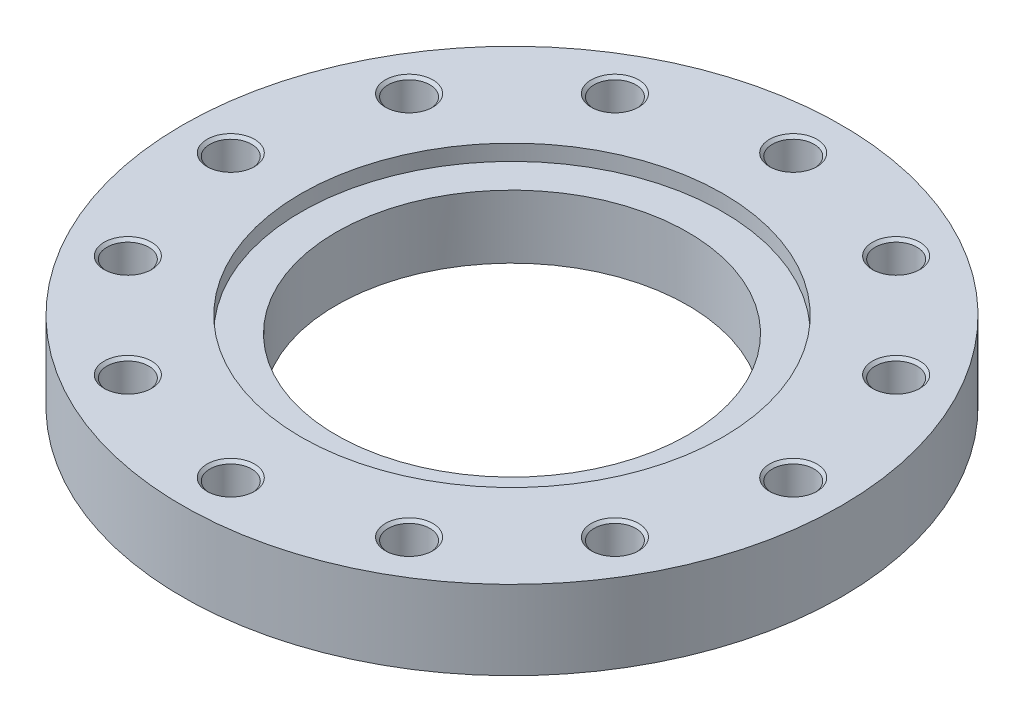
ISO-10303-21;
HEADER;
FILE_DESCRIPTION(('STEP AP214'),'2;1');
FILE_NAME('part.step','',(''),(''),'','','');
FILE_SCHEMA(('AUTOMOTIVE_DESIGN { 1 0 10303 214 1 1 1 1 }'));
ENDSEC;
DATA;
#1=APPLICATION_CONTEXT('core data for automotive mechanical design processes');
#2=APPLICATION_PROTOCOL_DEFINITION('international standard','automotive_design',2000,#1);
#3=PRODUCT_CONTEXT('',#1,'mechanical');
#4=PRODUCT('Part','Part','',(#3));
#5=PRODUCT_RELATED_PRODUCT_CATEGORY('part','',(#4));
#6=PRODUCT_DEFINITION_FORMATION('','',#4);
#7=PRODUCT_DEFINITION_CONTEXT('part definition',#1,'design');
#8=PRODUCT_DEFINITION('design','',#6,#7);
#9=PRODUCT_DEFINITION_SHAPE('','',#8);
#10=(LENGTH_UNIT() NAMED_UNIT(*) SI_UNIT(.MILLI.,.METRE.));
#11=(NAMED_UNIT(*) PLANE_ANGLE_UNIT() SI_UNIT($,.RADIAN.));
#12=(NAMED_UNIT(*) SI_UNIT($,.STERADIAN.) SOLID_ANGLE_UNIT());
#13=UNCERTAINTY_MEASURE_WITH_UNIT(LENGTH_MEASURE(1.E-05),#10,'distance_accuracy_value','');
#14=(GEOMETRIC_REPRESENTATION_CONTEXT(3) GLOBAL_UNCERTAINTY_ASSIGNED_CONTEXT((#13)) GLOBAL_UNIT_ASSIGNED_CONTEXT((#10,
#11,#12)) REPRESENTATION_CONTEXT('',''));
#15=CARTESIAN_POINT('',(0.,0.,0.));
#16=DIRECTION('',(0.,0.,1.));
#17=DIRECTION('',(1.,0.,0.));
#18=AXIS2_PLACEMENT_3D('',#15,#16,#17);
#19=CARTESIAN_POINT('',(0.,22.5,0.));
#20=DIRECTION('',(0.,-1.,0.));
#21=DIRECTION('',(1.,0.,0.));
#22=AXIS2_PLACEMENT_3D('',#19,#20,#21);
#23=CYLINDRICAL_SURFACE('',#22,187.5);
#24=CARTESIAN_POINT('',(0.,0.,0.));
#25=DIRECTION('',(0.,1.,0.));
#26=DIRECTION('',(1.,0.,0.));
#27=AXIS2_PLACEMENT_3D('',#24,#25,#26);
#28=CIRCLE('',#27,187.5);
#29=CARTESIAN_POINT('',(187.5,0.,0.));
#30=VERTEX_POINT('',#29);
#31=EDGE_CURVE('E9',#30,#30,#28,.T.);
#32=ORIENTED_EDGE('',*,*,#31,.T.);
#33=EDGE_LOOP('',(#32));
#34=FACE_BOUND('',#33,.T.);
#35=CARTESIAN_POINT('',(0.,45.,0.));
#36=DIRECTION('',(0.,1.,0.));
#37=DIRECTION('',(1.,0.,0.));
#38=AXIS2_PLACEMENT_3D('',#35,#36,#37);
#39=CIRCLE('',#38,187.5);
#40=CARTESIAN_POINT('',(187.5,45.,0.));
#41=VERTEX_POINT('',#40);
#42=EDGE_CURVE('E419',#41,#41,#39,.T.);
#43=ORIENTED_EDGE('',*,*,#42,.F.);
#44=EDGE_LOOP('',(#43));
#45=FACE_BOUND('',#44,.T.);
#46=ADVANCED_FACE('F15',(#34,#45),#23,.T.);
#47=CARTESIAN_POINT('',(143.75,0.,0.));
#48=DIRECTION('',(0.,-1.,0.));
#49=DIRECTION('',(-1.,0.,0.));
#50=AXIS2_PLACEMENT_3D('',#47,#48,#49);
#51=PLANE('',#50);
#52=CARTESIAN_POINT('',(0.,0.,0.));
#53=DIRECTION('',(0.,1.,0.));
#54=DIRECTION('',(1.,0.,0.));
#55=AXIS2_PLACEMENT_3D('',#52,#53,#54);
#56=CIRCLE('',#55,100.);
#57=CARTESIAN_POINT('',(100.,0.,0.));
#58=VERTEX_POINT('',#57);
#59=EDGE_CURVE('E19',#58,#58,#56,.T.);
#60=ORIENTED_EDGE('',*,*,#59,.T.);
#61=EDGE_LOOP('',(#60));
#62=FACE_BOUND('',#61,.T.);
#63=ORIENTED_EDGE('',*,*,#31,.F.);
#64=EDGE_LOOP('',(#63));
#65=FACE_BOUND('',#64,.T.);
#66=ADVANCED_FACE('F489',(#62,#65),#51,.T.);
#67=CARTESIAN_POINT('',(0.,22.5,0.));
#68=DIRECTION('',(0.,-1.,0.));
#69=DIRECTION('',(1.,0.,0.));
#70=AXIS2_PLACEMENT_3D('',#67,#68,#69);
#71=CYLINDRICAL_SURFACE('',#70,100.);
#72=ORIENTED_EDGE('',*,*,#59,.F.);
#73=EDGE_LOOP('',(#72));
#74=FACE_BOUND('',#73,.T.);
#75=CARTESIAN_POINT('',(0.,36.,0.));
#76=DIRECTION('',(0.,1.,0.));
#77=DIRECTION('',(1.,0.,0.));
#78=AXIS2_PLACEMENT_3D('',#75,#76,#77);
#79=CIRCLE('',#78,100.);
#80=CARTESIAN_POINT('',(-100.,36.,0.));
#81=VERTEX_POINT('',#80);
#82=EDGE_CURVE('E362',#81,#81,#79,.T.);
#83=ORIENTED_EDGE('',*,*,#82,.T.);
#84=EDGE_LOOP('',(#83));
#85=FACE_BOUND('',#84,.T.);
#86=ADVANCED_FACE('F17',(#74,#85),#71,.F.);
#87=CARTESIAN_POINT('',(143.75,45.,0.));
#88=DIRECTION('',(0.,1.,0.));
#89=DIRECTION('',(1.,0.,0.));
#90=AXIS2_PLACEMENT_3D('',#87,#88,#89);
#91=PLANE('',#90);
#92=ORIENTED_EDGE('',*,*,#42,.T.);
#93=EDGE_LOOP('',(#92));
#94=FACE_BOUND('',#93,.T.);
#95=CARTESIAN_POINT('',(0.,45.,0.));
#96=DIRECTION('',(0.,-1.,0.));
#97=DIRECTION('',(1.,0.,0.));
#98=AXIS2_PLACEMENT_3D('',#95,#96,#97);
#99=CIRCLE('',#98,120.);
#100=CARTESIAN_POINT('',(-120.,45.,0.));
#101=VERTEX_POINT('',#100);
#102=EDGE_CURVE('E160',#101,#101,#99,.T.);
#103=ORIENTED_EDGE('',*,*,#102,.T.);
#104=EDGE_LOOP('',(#103));
#105=FACE_BOUND('',#104,.T.);
#106=CARTESIAN_POINT('',(160.,45.,0.));
#107=DIRECTION('',(0.,-1.,0.));
#108=DIRECTION('',(1.,0.,0.));
#109=AXIS2_PLACEMENT_3D('',#106,#107,#108);
#110=CIRCLE('',#109,13.5);
#111=CARTESIAN_POINT('',(173.5,45.,0.));
#112=VERTEX_POINT('',#111);
#113=EDGE_CURVE('E416',#112,#112,#110,.T.);
#114=ORIENTED_EDGE('',*,*,#113,.T.);
#115=EDGE_LOOP('',(#114));
#116=FACE_BOUND('',#115,.T.);
#117=CARTESIAN_POINT('',(138.56406460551,45.,-80.));
#118=DIRECTION('',(0.,-1.,0.));
#119=DIRECTION('',(0.866025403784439,0.,-0.5));
#120=AXIS2_PLACEMENT_3D('',#117,#118,#119);
#121=CIRCLE('',#120,13.5);
#122=CARTESIAN_POINT('',(150.2554075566,45.,-86.75));
#123=VERTEX_POINT('',#122);
#124=EDGE_CURVE('E339',#123,#123,#121,.T.);
#125=ORIENTED_EDGE('',*,*,#124,.T.);
#126=EDGE_LOOP('',(#125));
#127=FACE_BOUND('',#126,.T.);
#128=CARTESIAN_POINT('',(80.,45.,-138.56406460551));
#129=DIRECTION('',(0.,-1.,0.));
#130=DIRECTION('',(0.5,0.,-0.866025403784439));
#131=AXIS2_PLACEMENT_3D('',#128,#129,#130);
#132=CIRCLE('',#131,13.5);
#133=CARTESIAN_POINT('',(86.75,45.,-150.2554075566));
#134=VERTEX_POINT('',#133);
#135=EDGE_CURVE('E395',#134,#134,#132,.T.);
#136=ORIENTED_EDGE('',*,*,#135,.T.);
#137=EDGE_LOOP('',(#136));
#138=FACE_BOUND('',#137,.T.);
#139=CARTESIAN_POINT('',(0.,45.,-160.));
#140=DIRECTION('',(0.,-1.,0.));
#141=DIRECTION('',(0.,0.,-1.));
#142=AXIS2_PLACEMENT_3D('',#139,#140,#141);
#143=CIRCLE('',#142,13.5);
#144=CARTESIAN_POINT('',(0.,45.,-173.5));
#145=VERTEX_POINT('',#144);
#146=EDGE_CURVE('E384',#145,#145,#143,.T.);
#147=ORIENTED_EDGE('',*,*,#146,.T.);
#148=EDGE_LOOP('',(#147));
#149=FACE_BOUND('',#148,.T.);
#150=CARTESIAN_POINT('',(-80.,45.,-138.56406460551));
#151=DIRECTION('',(0.,-1.,0.));
#152=DIRECTION('',(-0.5,0.,-0.866025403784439));
#153=AXIS2_PLACEMENT_3D('',#150,#151,#152);
#154=CIRCLE('',#153,13.5);
#155=CARTESIAN_POINT('',(-86.75,45.,-150.2554075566));
#156=VERTEX_POINT('',#155);
#157=EDGE_CURVE('E371',#156,#156,#154,.T.);
#158=ORIENTED_EDGE('',*,*,#157,.T.);
#159=EDGE_LOOP('',(#158));
#160=FACE_BOUND('',#159,.T.);
#161=CARTESIAN_POINT('',(-138.56406460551,45.,-80.));
#162=DIRECTION('',(0.,-1.,0.));
#163=DIRECTION('',(-0.866025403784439,0.,-0.5));
#164=AXIS2_PLACEMENT_3D('',#161,#162,#163);
#165=CIRCLE('',#164,13.5);
#166=CARTESIAN_POINT('',(-150.2554075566,45.,-86.75));
#167=VERTEX_POINT('',#166);
#168=EDGE_CURVE('E364',#167,#167,#165,.T.);
#169=ORIENTED_EDGE('',*,*,#168,.T.);
#170=EDGE_LOOP('',(#169));
#171=FACE_BOUND('',#170,.T.);
#172=CARTESIAN_POINT('',(-160.,45.,0.));
#173=DIRECTION('',(0.,-1.,0.));
#174=DIRECTION('',(-1.,0.,0.));
#175=AXIS2_PLACEMENT_3D('',#172,#173,#174);
#176=CIRCLE('',#175,13.5);
#177=CARTESIAN_POINT('',(-173.5,45.,0.));
#178=VERTEX_POINT('',#177);
#179=EDGE_CURVE('E249',#178,#178,#176,.T.);
#180=ORIENTED_EDGE('',*,*,#179,.T.);
#181=EDGE_LOOP('',(#180));
#182=FACE_BOUND('',#181,.T.);
#183=CARTESIAN_POINT('',(-138.56406460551,45.,80.));
#184=DIRECTION('',(0.,-1.,0.));
#185=DIRECTION('',(-0.866025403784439,0.,0.5));
#186=AXIS2_PLACEMENT_3D('',#183,#184,#185);
#187=CIRCLE('',#186,13.5);
#188=CARTESIAN_POINT('',(-150.2554075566,45.,86.75));
#189=VERTEX_POINT('',#188);
#190=EDGE_CURVE('E334',#189,#189,#187,.T.);
#191=ORIENTED_EDGE('',*,*,#190,.T.);
#192=EDGE_LOOP('',(#191));
#193=FACE_BOUND('',#192,.T.);
#194=CARTESIAN_POINT('',(-80.,45.,138.56406460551));
#195=DIRECTION('',(0.,-1.,0.));
#196=DIRECTION('',(-0.5,0.,0.866025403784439));
#197=AXIS2_PLACEMENT_3D('',#194,#195,#196);
#198=CIRCLE('',#197,13.5);
#199=CARTESIAN_POINT('',(-86.75,45.,150.2554075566));
#200=VERTEX_POINT('',#199);
#201=EDGE_CURVE('E316',#200,#200,#198,.T.);
#202=ORIENTED_EDGE('',*,*,#201,.T.);
#203=EDGE_LOOP('',(#202));
#204=FACE_BOUND('',#203,.T.);
#205=CARTESIAN_POINT('',(0.,45.,160.));
#206=DIRECTION('',(0.,-1.,0.));
#207=DIRECTION('',(0.,0.,1.));
#208=AXIS2_PLACEMENT_3D('',#205,#206,#207);
#209=CIRCLE('',#208,13.5);
#210=CARTESIAN_POINT('',(0.,45.,173.5));
#211=VERTEX_POINT('',#210);
#212=EDGE_CURVE('E309',#211,#211,#209,.T.);
#213=ORIENTED_EDGE('',*,*,#212,.T.);
#214=EDGE_LOOP('',(#213));
#215=FACE_BOUND('',#214,.T.);
#216=CARTESIAN_POINT('',(80.,45.,138.56406460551));
#217=DIRECTION('',(0.,-1.,0.));
#218=DIRECTION('',(0.5,0.,0.866025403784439));
#219=AXIS2_PLACEMENT_3D('',#216,#217,#218);
#220=CIRCLE('',#219,13.5);
#221=CARTESIAN_POINT('',(86.75,45.,150.2554075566));
#222=VERTEX_POINT('',#221);
#223=EDGE_CURVE('E439',#222,#222,#220,.T.);
#224=ORIENTED_EDGE('',*,*,#223,.T.);
#225=EDGE_LOOP('',(#224));
#226=FACE_BOUND('',#225,.T.);
#227=CARTESIAN_POINT('',(138.56406460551,45.,80.));
#228=DIRECTION('',(0.,-1.,0.));
#229=DIRECTION('',(0.866025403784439,0.,0.5));
#230=AXIS2_PLACEMENT_3D('',#227,#228,#229);
#231=CIRCLE('',#230,13.5);
#232=CARTESIAN_POINT('',(150.2554075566,45.,86.75));
#233=VERTEX_POINT('',#232);
#234=EDGE_CURVE('E453',#233,#233,#231,.T.);
#235=ORIENTED_EDGE('',*,*,#234,.T.);
#236=EDGE_LOOP('',(#235));
#237=FACE_BOUND('',#236,.T.);
#238=ADVANCED_FACE('F1195',(#94,#105,#116,#127,#138,#149,#160,#171,#182,#193,#204,#215,#226,
#237),#91,.T.);
#239=CARTESIAN_POINT('',(0.,36.,0.));
#240=DIRECTION('',(0.,-1.,0.));
#241=DIRECTION('',(-1.,0.,0.));
#242=AXIS2_PLACEMENT_3D('',#239,#240,#241);
#243=PLANE('',#242);
#244=CARTESIAN_POINT('',(0.,36.,0.));
#245=DIRECTION('',(0.,-1.,0.));
#246=DIRECTION('',(1.,0.,0.));
#247=AXIS2_PLACEMENT_3D('',#244,#245,#246);
#248=CIRCLE('',#247,120.);
#249=CARTESIAN_POINT('',(120.,36.,0.));
#250=VERTEX_POINT('',#249);
#251=EDGE_CURVE('E165',#250,#250,#248,.T.);
#252=ORIENTED_EDGE('',*,*,#251,.F.);
#253=EDGE_LOOP('',(#252));
#254=FACE_BOUND('',#253,.T.);
#255=ORIENTED_EDGE('',*,*,#82,.F.);
#256=EDGE_LOOP('',(#255));
#257=FACE_BOUND('',#256,.T.);
#258=ADVANCED_FACE('F1187',(#254,#257),#243,.F.);
#259=CARTESIAN_POINT('',(0.,42.75,0.));
#260=DIRECTION('',(0.,-1.,0.));
#261=DIRECTION('',(1.,0.,0.));
#262=AXIS2_PLACEMENT_3D('',#259,#260,#261);
#263=CYLINDRICAL_SURFACE('',#262,120.);
#264=ORIENTED_EDGE('',*,*,#251,.T.);
#265=EDGE_LOOP('',(#264));
#266=FACE_BOUND('',#265,.T.);
#267=ORIENTED_EDGE('',*,*,#102,.F.);
#268=EDGE_LOOP('',(#267));
#269=FACE_BOUND('',#268,.T.);
#270=ADVANCED_FACE('F1178',(#266,#269),#263,.F.);
#271=CARTESIAN_POINT('',(160.,5.57162193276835,0.));
#272=DIRECTION('',(0.,1.,0.));
#273=DIRECTION('',(1.,0.,0.));
#274=AXIS2_PLACEMENT_3D('',#271,#272,#273);
#275=CONICAL_SURFACE('',#274,5.938125,1.0471975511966);
#276=CARTESIAN_POINT('',(160.,9.,0.));
#277=DIRECTION('',(0.,-1.,0.));
#278=DIRECTION('',(1.,0.,0.));
#279=AXIS2_PLACEMENT_3D('',#276,#277,#278);
#280=CIRCLE('',#279,11.87625);
#281=CARTESIAN_POINT('',(171.87625,9.,0.));
#282=VERTEX_POINT('',#281);
#283=EDGE_CURVE('E372',#282,#282,#280,.T.);
#284=ORIENTED_EDGE('',*,*,#283,.F.);
#285=EDGE_LOOP('',(#284));
#286=FACE_BOUND('',#285,.T.);
#287=CARTESIAN_POINT('',(160.,2.1432438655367,0.));
#288=VERTEX_POINT('',#287);
#289=VERTEX_LOOP('',#288);
#290=FACE_BOUND('',#289,.T.);
#291=ADVANCED_FACE('F1169',(#286,#290),#275,.F.);
#292=CARTESIAN_POINT('',(160.,13.688125,0.));
#293=DIRECTION('',(0.,1.,0.));
#294=DIRECTION('',(1.,0.,0.));
#295=AXIS2_PLACEMENT_3D('',#292,#293,#294);
#296=CYLINDRICAL_SURFACE('',#295,11.87625);
#297=CARTESIAN_POINT('',(160.,18.37625,0.));
#298=DIRECTION('',(0.,-1.,0.));
#299=DIRECTION('',(1.,0.,0.));
#300=AXIS2_PLACEMENT_3D('',#297,#298,#299);
#301=CIRCLE('',#300,11.87625);
#302=CARTESIAN_POINT('',(171.87625,18.37625,0.));
#303=VERTEX_POINT('',#302);
#304=EDGE_CURVE('E352',#303,#303,#301,.T.);
#305=ORIENTED_EDGE('',*,*,#304,.F.);
#306=EDGE_LOOP('',(#305));
#307=FACE_BOUND('',#306,.T.);
#308=ORIENTED_EDGE('',*,*,#283,.T.);
#309=EDGE_LOOP('',(#308));
#310=FACE_BOUND('',#309,.T.);
#311=ADVANCED_FACE('F1160',(#307,#310),#296,.F.);
#312=CARTESIAN_POINT('',(160.,19.188125,0.));
#313=DIRECTION('',(0.,1.,0.));
#314=DIRECTION('',(1.,0.,0.));
#315=AXIS2_PLACEMENT_3D('',#312,#313,#314);
#316=CONICAL_SURFACE('',#315,12.688125,0.785398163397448);
#317=CARTESIAN_POINT('',(160.,20.,0.));
#318=DIRECTION('',(0.,-1.,0.));
#319=DIRECTION('',(1.,0.,0.));
#320=AXIS2_PLACEMENT_3D('',#317,#318,#319);
#321=CIRCLE('',#320,13.5);
#322=CARTESIAN_POINT('',(173.5,20.,0.));
#323=VERTEX_POINT('',#322);
#324=EDGE_CURVE('E350',#323,#323,#321,.T.);
#325=ORIENTED_EDGE('',*,*,#324,.F.);
#326=EDGE_LOOP('',(#325));
#327=FACE_BOUND('',#326,.T.);
#328=ORIENTED_EDGE('',*,*,#304,.T.);
#329=EDGE_LOOP('',(#328));
#330=FACE_BOUND('',#329,.T.);
#331=ADVANCED_FACE('F1151',(#327,#330),#316,.F.);
#332=CARTESIAN_POINT('',(172.688125,20.,0.));
#333=DIRECTION('',(0.,1.,0.));
#334=DIRECTION('',(-1.,0.,0.));
#335=AXIS2_PLACEMENT_3D('',#332,#333,#334);
#336=PLANE('',#335);
#337=CARTESIAN_POINT('',(160.,20.,0.));
#338=DIRECTION('',(0.,-1.,0.));
#339=DIRECTION('',(1.,0.,0.));
#340=AXIS2_PLACEMENT_3D('',#337,#338,#339);
#341=CIRCLE('',#340,11.87625);
#342=CARTESIAN_POINT('',(171.87625,20.,0.));
#343=VERTEX_POINT('',#342);
#344=EDGE_CURVE('E353',#343,#343,#341,.T.);
#345=ORIENTED_EDGE('',*,*,#344,.F.);
#346=EDGE_LOOP('',(#345));
#347=FACE_BOUND('',#346,.T.);
#348=ORIENTED_EDGE('',*,*,#324,.T.);
#349=EDGE_LOOP('',(#348));
#350=FACE_BOUND('',#349,.T.);
#351=ADVANCED_FACE('F1142',(#347,#350),#336,.F.);
#352=CARTESIAN_POINT('',(160.,31.688125,0.));
#353=DIRECTION('',(0.,1.,0.));
#354=DIRECTION('',(1.,0.,0.));
#355=AXIS2_PLACEMENT_3D('',#352,#353,#354);
#356=CYLINDRICAL_SURFACE('',#355,11.87625);
#357=CARTESIAN_POINT('',(160.,43.37625,0.));
#358=DIRECTION('',(0.,-1.,0.));
#359=DIRECTION('',(1.,0.,0.));
#360=AXIS2_PLACEMENT_3D('',#357,#358,#359);
#361=CIRCLE('',#360,11.87625);
#362=CARTESIAN_POINT('',(171.87625,43.37625,0.));
#363=VERTEX_POINT('',#362);
#364=EDGE_CURVE('E414',#363,#363,#361,.T.);
#365=ORIENTED_EDGE('',*,*,#364,.F.);
#366=EDGE_LOOP('',(#365));
#367=FACE_BOUND('',#366,.T.);
#368=ORIENTED_EDGE('',*,*,#344,.T.);
#369=EDGE_LOOP('',(#368));
#370=FACE_BOUND('',#369,.T.);
#371=ADVANCED_FACE('F1133',(#367,#370),#356,.F.);
#372=CARTESIAN_POINT('',(160.,44.188125,0.));
#373=DIRECTION('',(0.,1.,0.));
#374=DIRECTION('',(1.,0.,0.));
#375=AXIS2_PLACEMENT_3D('',#372,#373,#374);
#376=CONICAL_SURFACE('',#375,12.688125,0.785398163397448);
#377=ORIENTED_EDGE('',*,*,#113,.F.);
#378=EDGE_LOOP('',(#377));
#379=FACE_BOUND('',#378,.T.);
#380=ORIENTED_EDGE('',*,*,#364,.T.);
#381=EDGE_LOOP('',(#380));
#382=FACE_BOUND('',#381,.T.);
#383=ADVANCED_FACE('F1124',(#379,#382),#376,.F.);
#384=CARTESIAN_POINT('',(138.56406460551,5.57162193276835,-80.));
#385=DIRECTION('',(0.,1.,0.));
#386=DIRECTION('',(0.866025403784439,0.,-0.5));
#387=AXIS2_PLACEMENT_3D('',#384,#385,#386);
#388=CONICAL_SURFACE('',#387,5.938125,1.0471975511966);
#389=CARTESIAN_POINT('',(138.56406460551,9.,-80.));
#390=DIRECTION('',(0.,-1.,0.));
#391=DIRECTION('',(0.866025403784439,0.,-0.5));
#392=AXIS2_PLACEMENT_3D('',#389,#390,#391);
#393=CIRCLE('',#392,11.87625);
#394=CARTESIAN_POINT('',(148.849198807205,9.,-85.938125));
#395=VERTEX_POINT('',#394);
#396=EDGE_CURVE('E412',#395,#395,#393,.T.);
#397=ORIENTED_EDGE('',*,*,#396,.F.);
#398=EDGE_LOOP('',(#397));
#399=FACE_BOUND('',#398,.T.);
#400=CARTESIAN_POINT('',(138.56406460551,2.1432438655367,-80.));
#401=VERTEX_POINT('',#400);
#402=VERTEX_LOOP('',#401);
#403=FACE_BOUND('',#402,.T.);
#404=ADVANCED_FACE('F1115',(#399,#403),#388,.F.);
#405=CARTESIAN_POINT('',(138.56406460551,13.688125,-80.));
#406=DIRECTION('',(0.,1.,0.));
#407=DIRECTION('',(0.866025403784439,0.,-0.5));
#408=AXIS2_PLACEMENT_3D('',#405,#406,#407);
#409=CYLINDRICAL_SURFACE('',#408,11.87625);
#410=CARTESIAN_POINT('',(138.56406460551,18.37625,-80.));
#411=DIRECTION('',(0.,-1.,0.));
#412=DIRECTION('',(0.866025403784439,0.,-0.5));
#413=AXIS2_PLACEMENT_3D('',#410,#411,#412);
#414=CIRCLE('',#413,11.87625);
#415=CARTESIAN_POINT('',(148.849198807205,18.37625,-85.938125));
#416=VERTEX_POINT('',#415);
#417=EDGE_CURVE('E410',#416,#416,#414,.T.);
#418=ORIENTED_EDGE('',*,*,#417,.F.);
#419=EDGE_LOOP('',(#418));
#420=FACE_BOUND('',#419,.T.);
#421=ORIENTED_EDGE('',*,*,#396,.T.);
#422=EDGE_LOOP('',(#421));
#423=FACE_BOUND('',#422,.T.);
#424=ADVANCED_FACE('F1106',(#420,#423),#409,.F.);
#425=CARTESIAN_POINT('',(138.56406460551,19.188125,-80.));
#426=DIRECTION('',(0.,1.,0.));
#427=DIRECTION('',(0.866025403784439,0.,-0.5));
#428=AXIS2_PLACEMENT_3D('',#425,#426,#427);
#429=CONICAL_SURFACE('',#428,12.688125,0.785398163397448);
#430=CARTESIAN_POINT('',(138.56406460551,20.,-80.));
#431=DIRECTION('',(0.,-1.,0.));
#432=DIRECTION('',(0.866025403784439,0.,-0.5));
#433=AXIS2_PLACEMENT_3D('',#430,#431,#432);
#434=CIRCLE('',#433,13.5);
#435=CARTESIAN_POINT('',(150.2554075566,20.,-86.75));
#436=VERTEX_POINT('',#435);
#437=EDGE_CURVE('E408',#436,#436,#434,.T.);
#438=ORIENTED_EDGE('',*,*,#437,.F.);
#439=EDGE_LOOP('',(#438));
#440=FACE_BOUND('',#439,.T.);
#441=ORIENTED_EDGE('',*,*,#417,.T.);
#442=EDGE_LOOP('',(#441));
#443=FACE_BOUND('',#442,.T.);
#444=ADVANCED_FACE('F1097',(#440,#443),#429,.F.);
#445=CARTESIAN_POINT('',(149.552303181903,20.,-86.3440625));
#446=DIRECTION('',(0.,1.,0.));
#447=DIRECTION('',(-0.866025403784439,0.,0.5));
#448=AXIS2_PLACEMENT_3D('',#445,#446,#447);
#449=PLANE('',#448);
#450=CARTESIAN_POINT('',(138.56406460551,20.,-80.));
#451=DIRECTION('',(0.,-1.,0.));
#452=DIRECTION('',(0.866025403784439,0.,-0.5));
#453=AXIS2_PLACEMENT_3D('',#450,#451,#452);
#454=CIRCLE('',#453,11.87625);
#455=CARTESIAN_POINT('',(148.849198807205,20.,-85.938125));
#456=VERTEX_POINT('',#455);
#457=EDGE_CURVE('E405',#456,#456,#454,.T.);
#458=ORIENTED_EDGE('',*,*,#457,.F.);
#459=EDGE_LOOP('',(#458));
#460=FACE_BOUND('',#459,.T.);
#461=ORIENTED_EDGE('',*,*,#437,.T.);
#462=EDGE_LOOP('',(#461));
#463=FACE_BOUND('',#462,.T.);
#464=ADVANCED_FACE('F1088',(#460,#463),#449,.F.);
#465=CARTESIAN_POINT('',(138.56406460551,31.688125,-80.));
#466=DIRECTION('',(0.,1.,0.));
#467=DIRECTION('',(0.866025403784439,0.,-0.5));
#468=AXIS2_PLACEMENT_3D('',#465,#466,#467);
#469=CYLINDRICAL_SURFACE('',#468,11.87625);
#470=CARTESIAN_POINT('',(138.56406460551,43.37625,-80.));
#471=DIRECTION('',(0.,-1.,0.));
#472=DIRECTION('',(0.866025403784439,0.,-0.5));
#473=AXIS2_PLACEMENT_3D('',#470,#471,#472);
#474=CIRCLE('',#473,11.87625);
#475=CARTESIAN_POINT('',(148.849198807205,43.37625,-85.938125));
#476=VERTEX_POINT('',#475);
#477=EDGE_CURVE('E337',#476,#476,#474,.T.);
#478=ORIENTED_EDGE('',*,*,#477,.F.);
#479=EDGE_LOOP('',(#478));
#480=FACE_BOUND('',#479,.T.);
#481=ORIENTED_EDGE('',*,*,#457,.T.);
#482=EDGE_LOOP('',(#481));
#483=FACE_BOUND('',#482,.T.);
#484=ADVANCED_FACE('F1079',(#480,#483),#469,.F.);
#485=CARTESIAN_POINT('',(138.56406460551,44.188125,-80.));
#486=DIRECTION('',(0.,1.,0.));
#487=DIRECTION('',(0.866025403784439,0.,-0.5));
#488=AXIS2_PLACEMENT_3D('',#485,#486,#487);
#489=CONICAL_SURFACE('',#488,12.688125,0.785398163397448);
#490=ORIENTED_EDGE('',*,*,#124,.F.);
#491=EDGE_LOOP('',(#490));
#492=FACE_BOUND('',#491,.T.);
#493=ORIENTED_EDGE('',*,*,#477,.T.);
#494=EDGE_LOOP('',(#493));
#495=FACE_BOUND('',#494,.T.);
#496=ADVANCED_FACE('F1070',(#492,#495),#489,.F.);
#497=CARTESIAN_POINT('',(80.,5.57162193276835,-138.56406460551));
#498=DIRECTION('',(0.,1.,0.));
#499=DIRECTION('',(0.5,0.,-0.866025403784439));
#500=AXIS2_PLACEMENT_3D('',#497,#498,#499);
#501=CONICAL_SURFACE('',#500,5.938125,1.0471975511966);
#502=CARTESIAN_POINT('',(80.,9.,-138.56406460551));
#503=DIRECTION('',(0.,-1.,0.));
#504=DIRECTION('',(0.5,0.,-0.866025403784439));
#505=AXIS2_PLACEMENT_3D('',#502,#503,#504);
#506=CIRCLE('',#505,11.87625);
#507=CARTESIAN_POINT('',(85.938125,9.,-148.849198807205));
#508=VERTEX_POINT('',#507);
#509=EDGE_CURVE('E340',#508,#508,#506,.T.);
#510=ORIENTED_EDGE('',*,*,#509,.F.);
#511=EDGE_LOOP('',(#510));
#512=FACE_BOUND('',#511,.T.);
#513=CARTESIAN_POINT('',(80.,2.1432438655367,-138.56406460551));
#514=VERTEX_POINT('',#513);
#515=VERTEX_LOOP('',#514);
#516=FACE_BOUND('',#515,.T.);
#517=ADVANCED_FACE('F1061',(#512,#516),#501,.F.);
#518=CARTESIAN_POINT('',(80.,13.688125,-138.56406460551));
#519=DIRECTION('',(0.,1.,0.));
#520=DIRECTION('',(0.5,0.,-0.866025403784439));
#521=AXIS2_PLACEMENT_3D('',#518,#519,#520);
#522=CYLINDRICAL_SURFACE('',#521,11.87625);
#523=CARTESIAN_POINT('',(80.,18.37625,-138.56406460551));
#524=DIRECTION('',(0.,-1.,0.));
#525=DIRECTION('',(0.5,0.,-0.866025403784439));
#526=AXIS2_PLACEMENT_3D('',#523,#524,#525);
#527=CIRCLE('',#526,11.87625);
#528=CARTESIAN_POINT('',(85.938125,18.37625,-148.849198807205));
#529=VERTEX_POINT('',#528);
#530=EDGE_CURVE('E401',#529,#529,#527,.T.);
#531=ORIENTED_EDGE('',*,*,#530,.F.);
#532=EDGE_LOOP('',(#531));
#533=FACE_BOUND('',#532,.T.);
#534=ORIENTED_EDGE('',*,*,#509,.T.);
#535=EDGE_LOOP('',(#534));
#536=FACE_BOUND('',#535,.T.);
#537=ADVANCED_FACE('F1052',(#533,#536),#522,.F.);
#538=CARTESIAN_POINT('',(80.,19.188125,-138.56406460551));
#539=DIRECTION('',(0.,1.,0.));
#540=DIRECTION('',(0.5,0.,-0.866025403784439));
#541=AXIS2_PLACEMENT_3D('',#538,#539,#540);
#542=CONICAL_SURFACE('',#541,12.688125,0.785398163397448);
#543=CARTESIAN_POINT('',(80.,20.,-138.56406460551));
#544=DIRECTION('',(0.,-1.,0.));
#545=DIRECTION('',(0.5,0.,-0.866025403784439));
#546=AXIS2_PLACEMENT_3D('',#543,#544,#545);
#547=CIRCLE('',#546,13.5);
#548=CARTESIAN_POINT('',(86.75,20.,-150.2554075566));
#549=VERTEX_POINT('',#548);
#550=EDGE_CURVE('E399',#549,#549,#547,.T.);
#551=ORIENTED_EDGE('',*,*,#550,.F.);
#552=EDGE_LOOP('',(#551));
#553=FACE_BOUND('',#552,.T.);
#554=ORIENTED_EDGE('',*,*,#530,.T.);
#555=EDGE_LOOP('',(#554));
#556=FACE_BOUND('',#555,.T.);
#557=ADVANCED_FACE('F1043',(#553,#556),#542,.F.);
#558=CARTESIAN_POINT('',(86.3440625,20.,-149.552303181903));
#559=DIRECTION('',(0.,1.,0.));
#560=DIRECTION('',(-0.5,0.,0.866025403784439));
#561=AXIS2_PLACEMENT_3D('',#558,#559,#560);
#562=PLANE('',#561);
#563=CARTESIAN_POINT('',(80.,20.,-138.56406460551));
#564=DIRECTION('',(0.,-1.,0.));
#565=DIRECTION('',(0.5,0.,-0.866025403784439));
#566=AXIS2_PLACEMENT_3D('',#563,#564,#565);
#567=CIRCLE('',#566,11.87625);
#568=CARTESIAN_POINT('',(85.938125,20.,-148.849198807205));
#569=VERTEX_POINT('',#568);
#570=EDGE_CURVE('E397',#569,#569,#567,.T.);
#571=ORIENTED_EDGE('',*,*,#570,.F.);
#572=EDGE_LOOP('',(#571));
#573=FACE_BOUND('',#572,.T.);
#574=ORIENTED_EDGE('',*,*,#550,.T.);
#575=EDGE_LOOP('',(#574));
#576=FACE_BOUND('',#575,.T.);
#577=ADVANCED_FACE('F1034',(#573,#576),#562,.F.);
#578=CARTESIAN_POINT('',(80.,31.688125,-138.56406460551));
#579=DIRECTION('',(0.,1.,0.));
#580=DIRECTION('',(0.5,0.,-0.866025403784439));
#581=AXIS2_PLACEMENT_3D('',#578,#579,#580);
#582=CYLINDRICAL_SURFACE('',#581,11.87625);
#583=CARTESIAN_POINT('',(80.,43.37625,-138.56406460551));
#584=DIRECTION('',(0.,-1.,0.));
#585=DIRECTION('',(0.5,0.,-0.866025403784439));
#586=AXIS2_PLACEMENT_3D('',#583,#584,#585);
#587=CIRCLE('',#586,11.87625);
#588=CARTESIAN_POINT('',(85.938125,43.37625,-148.849198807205));
#589=VERTEX_POINT('',#588);
#590=EDGE_CURVE('E393',#589,#589,#587,.T.);
#591=ORIENTED_EDGE('',*,*,#590,.F.);
#592=EDGE_LOOP('',(#591));
#593=FACE_BOUND('',#592,.T.);
#594=ORIENTED_EDGE('',*,*,#570,.T.);
#595=EDGE_LOOP('',(#594));
#596=FACE_BOUND('',#595,.T.);
#597=ADVANCED_FACE('F485',(#593,#596),#582,.F.);
#598=CARTESIAN_POINT('',(80.,44.188125,-138.56406460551));
#599=DIRECTION('',(0.,1.,0.));
#600=DIRECTION('',(0.5,0.,-0.866025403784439));
#601=AXIS2_PLACEMENT_3D('',#598,#599,#600);
#602=CONICAL_SURFACE('',#601,12.688125,0.785398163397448);
#603=ORIENTED_EDGE('',*,*,#135,.F.);
#604=EDGE_LOOP('',(#603));
#605=FACE_BOUND('',#604,.T.);
#606=ORIENTED_EDGE('',*,*,#590,.T.);
#607=EDGE_LOOP('',(#606));
#608=FACE_BOUND('',#607,.T.);
#609=ADVANCED_FACE('F479',(#605,#608),#602,.F.);
#610=CARTESIAN_POINT('',(0.,5.57162193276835,-160.));
#611=DIRECTION('',(0.,1.,0.));
#612=DIRECTION('',(0.,0.,-1.));
#613=AXIS2_PLACEMENT_3D('',#610,#611,#612);
#614=CONICAL_SURFACE('',#613,5.938125,1.0471975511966);
#615=CARTESIAN_POINT('',(0.,9.,-160.));
#616=DIRECTION('',(0.,-1.,0.));
#617=DIRECTION('',(0.,0.,-1.));
#618=AXIS2_PLACEMENT_3D('',#615,#616,#617);
#619=CIRCLE('',#618,11.87625);
#620=CARTESIAN_POINT('',(0.,9.,-171.87625));
#621=VERTEX_POINT('',#620);
#622=EDGE_CURVE('E390',#621,#621,#619,.T.);
#623=ORIENTED_EDGE('',*,*,#622,.F.);
#624=EDGE_LOOP('',(#623));
#625=FACE_BOUND('',#624,.T.);
#626=CARTESIAN_POINT('',(0.,2.1432438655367,-160.));
#627=VERTEX_POINT('',#626);
#628=VERTEX_LOOP('',#627);
#629=FACE_BOUND('',#628,.T.);
#630=ADVANCED_FACE('F473',(#625,#629),#614,.F.);
#631=CARTESIAN_POINT('',(0.,13.688125,-160.));
#632=DIRECTION('',(0.,1.,0.));
#633=DIRECTION('',(0.,0.,-1.));
#634=AXIS2_PLACEMENT_3D('',#631,#632,#633);
#635=CYLINDRICAL_SURFACE('',#634,11.87625);
#636=CARTESIAN_POINT('',(0.,18.37625,-160.));
#637=DIRECTION('',(0.,-1.,0.));
#638=DIRECTION('',(0.,0.,-1.));
#639=AXIS2_PLACEMENT_3D('',#636,#637,#638);
#640=CIRCLE('',#639,11.87625);
#641=CARTESIAN_POINT('',(0.,18.37625,-171.87625));
#642=VERTEX_POINT('',#641);
#643=EDGE_CURVE('E387',#642,#642,#640,.T.);
#644=ORIENTED_EDGE('',*,*,#643,.F.);
#645=EDGE_LOOP('',(#644));
#646=FACE_BOUND('',#645,.T.);
#647=ORIENTED_EDGE('',*,*,#622,.T.);
#648=EDGE_LOOP('',(#647));
#649=FACE_BOUND('',#648,.T.);
#650=ADVANCED_FACE('F467',(#646,#649),#635,.F.);
#651=CARTESIAN_POINT('',(0.,19.188125,-160.));
#652=DIRECTION('',(0.,1.,0.));
#653=DIRECTION('',(0.,0.,-1.));
#654=AXIS2_PLACEMENT_3D('',#651,#652,#653);
#655=CONICAL_SURFACE('',#654,12.688125,0.785398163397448);
#656=CARTESIAN_POINT('',(0.,20.,-160.));
#657=DIRECTION('',(0.,-1.,0.));
#658=DIRECTION('',(0.,0.,-1.));
#659=AXIS2_PLACEMENT_3D('',#656,#657,#658);
#660=CIRCLE('',#659,13.5);
#661=CARTESIAN_POINT('',(0.,20.,-173.5));
#662=VERTEX_POINT('',#661);
#663=EDGE_CURVE('E391',#662,#662,#660,.T.);
#664=ORIENTED_EDGE('',*,*,#663,.F.);
#665=EDGE_LOOP('',(#664));
#666=FACE_BOUND('',#665,.T.);
#667=ORIENTED_EDGE('',*,*,#643,.T.);
#668=EDGE_LOOP('',(#667));
#669=FACE_BOUND('',#668,.T.);
#670=ADVANCED_FACE('F461',(#666,#669),#655,.F.);
#671=CARTESIAN_POINT('',(0.,20.,-172.688125));
#672=DIRECTION('',(0.,1.,0.));
#673=DIRECTION('',(0.,0.,1.));
#674=AXIS2_PLACEMENT_3D('',#671,#672,#673);
#675=PLANE('',#674);
#676=CARTESIAN_POINT('',(0.,20.,-160.));
#677=DIRECTION('',(0.,-1.,0.));
#678=DIRECTION('',(0.,0.,-1.));
#679=AXIS2_PLACEMENT_3D('',#676,#677,#678);
#680=CIRCLE('',#679,11.87625);
#681=CARTESIAN_POINT('',(0.,20.,-171.87625));
#682=VERTEX_POINT('',#681);
#683=EDGE_CURVE('E386',#682,#682,#680,.T.);
#684=ORIENTED_EDGE('',*,*,#683,.F.);
#685=EDGE_LOOP('',(#684));
#686=FACE_BOUND('',#685,.T.);
#687=ORIENTED_EDGE('',*,*,#663,.T.);
#688=EDGE_LOOP('',(#687));
#689=FACE_BOUND('',#688,.T.);
#690=ADVANCED_FACE('F458',(#686,#689),#675,.F.);
#691=CARTESIAN_POINT('',(0.,31.688125,-160.));
#692=DIRECTION('',(0.,1.,0.));
#693=DIRECTION('',(0.,0.,-1.));
#694=AXIS2_PLACEMENT_3D('',#691,#692,#693);
#695=CYLINDRICAL_SURFACE('',#694,11.87625);
#696=CARTESIAN_POINT('',(0.,43.37625,-160.));
#697=DIRECTION('',(0.,-1.,0.));
#698=DIRECTION('',(0.,0.,-1.));
#699=AXIS2_PLACEMENT_3D('',#696,#697,#698);
#700=CIRCLE('',#699,11.87625);
#701=CARTESIAN_POINT('',(0.,43.37625,-171.87625));
#702=VERTEX_POINT('',#701);
#703=EDGE_CURVE('E382',#702,#702,#700,.T.);
#704=ORIENTED_EDGE('',*,*,#703,.F.);
#705=EDGE_LOOP('',(#704));
#706=FACE_BOUND('',#705,.T.);
#707=ORIENTED_EDGE('',*,*,#683,.T.);
#708=EDGE_LOOP('',(#707));
#709=FACE_BOUND('',#708,.T.);
#710=ADVANCED_FACE('F456',(#706,#709),#695,.F.);
#711=CARTESIAN_POINT('',(0.,44.188125,-160.));
#712=DIRECTION('',(0.,1.,0.));
#713=DIRECTION('',(0.,0.,-1.));
#714=AXIS2_PLACEMENT_3D('',#711,#712,#713);
#715=CONICAL_SURFACE('',#714,12.688125,0.785398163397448);
#716=ORIENTED_EDGE('',*,*,#146,.F.);
#717=EDGE_LOOP('',(#716));
#718=FACE_BOUND('',#717,.T.);
#719=ORIENTED_EDGE('',*,*,#703,.T.);
#720=EDGE_LOOP('',(#719));
#721=FACE_BOUND('',#720,.T.);
#722=ADVANCED_FACE('F512',(#718,#721),#715,.F.);
#723=CARTESIAN_POINT('',(-80.,5.57162193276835,-138.56406460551));
#724=DIRECTION('',(0.,1.,0.));
#725=DIRECTION('',(-0.5,0.,-0.866025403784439));
#726=AXIS2_PLACEMENT_3D('',#723,#724,#725);
#727=CONICAL_SURFACE('',#726,5.938125,1.0471975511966);
#728=CARTESIAN_POINT('',(-80.,9.,-138.56406460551));
#729=DIRECTION('',(0.,-1.,0.));
#730=DIRECTION('',(-0.5,0.,-0.866025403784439));
#731=AXIS2_PLACEMENT_3D('',#728,#729,#730);
#732=CIRCLE('',#731,11.87625);
#733=CARTESIAN_POINT('',(-85.938125,9.,-148.849198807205));
#734=VERTEX_POINT('',#733);
#735=EDGE_CURVE('E381',#734,#734,#732,.T.);
#736=ORIENTED_EDGE('',*,*,#735,.F.);
#737=EDGE_LOOP('',(#736));
#738=FACE_BOUND('',#737,.T.);
#739=CARTESIAN_POINT('',(-80.,2.1432438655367,-138.56406460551));
#740=VERTEX_POINT('',#739);
#741=VERTEX_LOOP('',#740);
#742=FACE_BOUND('',#741,.T.);
#743=ADVANCED_FACE('F508',(#738,#742),#727,.F.);
#744=CARTESIAN_POINT('',(-80.,13.688125,-138.56406460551));
#745=DIRECTION('',(0.,1.,0.));
#746=DIRECTION('',(-0.5,0.,-0.866025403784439));
#747=AXIS2_PLACEMENT_3D('',#744,#745,#746);
#748=CYLINDRICAL_SURFACE('',#747,11.87625);
#749=CARTESIAN_POINT('',(-80.,18.37625,-138.56406460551));
#750=DIRECTION('',(0.,-1.,0.));
#751=DIRECTION('',(-0.5,0.,-0.866025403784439));
#752=AXIS2_PLACEMENT_3D('',#749,#750,#751);
#753=CIRCLE('',#752,11.87625);
#754=CARTESIAN_POINT('',(-85.938125,18.37625,-148.849198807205));
#755=VERTEX_POINT('',#754);
#756=EDGE_CURVE('E379',#755,#755,#753,.T.);
#757=ORIENTED_EDGE('',*,*,#756,.F.);
#758=EDGE_LOOP('',(#757));
#759=FACE_BOUND('',#758,.T.);
#760=ORIENTED_EDGE('',*,*,#735,.T.);
#761=EDGE_LOOP('',(#760));
#762=FACE_BOUND('',#761,.T.);
#763=ADVANCED_FACE('F504',(#759,#762),#748,.F.);
#764=CARTESIAN_POINT('',(-80.,19.188125,-138.56406460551));
#765=DIRECTION('',(0.,1.,0.));
#766=DIRECTION('',(-0.5,0.,-0.866025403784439));
#767=AXIS2_PLACEMENT_3D('',#764,#765,#766);
#768=CONICAL_SURFACE('',#767,12.688125,0.785398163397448);
#769=CARTESIAN_POINT('',(-80.,20.,-138.56406460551));
#770=DIRECTION('',(0.,-1.,0.));
#771=DIRECTION('',(-0.5,0.,-0.866025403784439));
#772=AXIS2_PLACEMENT_3D('',#769,#770,#771);
#773=CIRCLE('',#772,13.5);
#774=CARTESIAN_POINT('',(-86.75,20.,-150.2554075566));
#775=VERTEX_POINT('',#774);
#776=EDGE_CURVE('E377',#775,#775,#773,.T.);
#777=ORIENTED_EDGE('',*,*,#776,.F.);
#778=EDGE_LOOP('',(#777));
#779=FACE_BOUND('',#778,.T.);
#780=ORIENTED_EDGE('',*,*,#756,.T.);
#781=EDGE_LOOP('',(#780));
#782=FACE_BOUND('',#781,.T.);
#783=ADVANCED_FACE('F501',(#779,#782),#768,.F.);
#784=CARTESIAN_POINT('',(-86.3440625,20.,-149.552303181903));
#785=DIRECTION('',(0.,1.,0.));
#786=DIRECTION('',(0.5,0.,0.866025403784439));
#787=AXIS2_PLACEMENT_3D('',#784,#785,#786);
#788=PLANE('',#787);
#789=CARTESIAN_POINT('',(-80.,20.,-138.56406460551));
#790=DIRECTION('',(0.,-1.,0.));
#791=DIRECTION('',(-0.5,0.,-0.866025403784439));
#792=AXIS2_PLACEMENT_3D('',#789,#790,#791);
#793=CIRCLE('',#792,11.87625);
#794=CARTESIAN_POINT('',(-85.938125,20.,-148.849198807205));
#795=VERTEX_POINT('',#794);
#796=EDGE_CURVE('E375',#795,#795,#793,.T.);
#797=ORIENTED_EDGE('',*,*,#796,.F.);
#798=EDGE_LOOP('',(#797));
#799=FACE_BOUND('',#798,.T.);
#800=ORIENTED_EDGE('',*,*,#776,.T.);
#801=EDGE_LOOP('',(#800));
#802=FACE_BOUND('',#801,.T.);
#803=ADVANCED_FACE('F499',(#799,#802),#788,.F.);
#804=CARTESIAN_POINT('',(-80.,31.688125,-138.56406460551));
#805=DIRECTION('',(0.,1.,0.));
#806=DIRECTION('',(-0.5,0.,-0.866025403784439));
#807=AXIS2_PLACEMENT_3D('',#804,#805,#806);
#808=CYLINDRICAL_SURFACE('',#807,11.87625);
#809=CARTESIAN_POINT('',(-80.,43.37625,-138.56406460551));
#810=DIRECTION('',(0.,-1.,0.));
#811=DIRECTION('',(-0.5,0.,-0.866025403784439));
#812=AXIS2_PLACEMENT_3D('',#809,#810,#811);
#813=CIRCLE('',#812,11.87625);
#814=CARTESIAN_POINT('',(-85.938125,43.37625,-148.849198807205));
#815=VERTEX_POINT('',#814);
#816=EDGE_CURVE('E369',#815,#815,#813,.T.);
#817=ORIENTED_EDGE('',*,*,#816,.F.);
#818=EDGE_LOOP('',(#817));
#819=FACE_BOUND('',#818,.T.);
#820=ORIENTED_EDGE('',*,*,#796,.T.);
#821=EDGE_LOOP('',(#820));
#822=FACE_BOUND('',#821,.T.);
#823=ADVANCED_FACE('F549',(#819,#822),#808,.F.);
#824=CARTESIAN_POINT('',(-80.,44.188125,-138.56406460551));
#825=DIRECTION('',(0.,1.,0.));
#826=DIRECTION('',(-0.5,0.,-0.866025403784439));
#827=AXIS2_PLACEMENT_3D('',#824,#825,#826);
#828=CONICAL_SURFACE('',#827,12.688125,0.785398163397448);
#829=ORIENTED_EDGE('',*,*,#157,.F.);
#830=EDGE_LOOP('',(#829));
#831=FACE_BOUND('',#830,.T.);
#832=ORIENTED_EDGE('',*,*,#816,.T.);
#833=EDGE_LOOP('',(#832));
#834=FACE_BOUND('',#833,.T.);
#835=ADVANCED_FACE('F556',(#831,#834),#828,.F.);
#836=CARTESIAN_POINT('',(-138.56406460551,5.57162193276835,-80.));
#837=DIRECTION('',(0.,1.,0.));
#838=DIRECTION('',(-0.866025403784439,0.,-0.5));
#839=AXIS2_PLACEMENT_3D('',#836,#837,#838);
#840=CONICAL_SURFACE('',#839,5.938125,1.0471975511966);
#841=CARTESIAN_POINT('',(-138.56406460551,9.,-80.));
#842=DIRECTION('',(0.,-1.,0.));
#843=DIRECTION('',(-0.866025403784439,0.,-0.5));
#844=AXIS2_PLACEMENT_3D('',#841,#842,#843);
#845=CIRCLE('',#844,11.87625);
#846=CARTESIAN_POINT('',(-148.849198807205,9.,-85.9381250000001));
#847=VERTEX_POINT('',#846);
#848=EDGE_CURVE('E327',#847,#847,#845,.T.);
#849=ORIENTED_EDGE('',*,*,#848,.F.);
#850=EDGE_LOOP('',(#849));
#851=FACE_BOUND('',#850,.T.);
#852=CARTESIAN_POINT('',(-138.56406460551,2.1432438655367,-80.));
#853=VERTEX_POINT('',#852);
#854=VERTEX_LOOP('',#853);
#855=FACE_BOUND('',#854,.T.);
#856=ADVANCED_FACE('F563',(#851,#855),#840,.F.);
#857=CARTESIAN_POINT('',(-138.56406460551,13.688125,-80.));
#858=DIRECTION('',(0.,1.,0.));
#859=DIRECTION('',(-0.866025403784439,0.,-0.5));
#860=AXIS2_PLACEMENT_3D('',#857,#858,#859);
#861=CYLINDRICAL_SURFACE('',#860,11.87625);
#862=CARTESIAN_POINT('',(-138.56406460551,18.37625,-80.));
#863=DIRECTION('',(0.,-1.,0.));
#864=DIRECTION('',(-0.866025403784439,0.,-0.5));
#865=AXIS2_PLACEMENT_3D('',#862,#863,#864);
#866=CIRCLE('',#865,11.87625);
#867=CARTESIAN_POINT('',(-148.849198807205,18.37625,-85.9381250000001));
#868=VERTEX_POINT('',#867);
#869=EDGE_CURVE('E325',#868,#868,#866,.T.);
#870=ORIENTED_EDGE('',*,*,#869,.F.);
#871=EDGE_LOOP('',(#870));
#872=FACE_BOUND('',#871,.T.);
#873=ORIENTED_EDGE('',*,*,#848,.T.);
#874=EDGE_LOOP('',(#873));
#875=FACE_BOUND('',#874,.T.);
#876=ADVANCED_FACE('F571',(#872,#875),#861,.F.);
#877=CARTESIAN_POINT('',(-138.56406460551,19.188125,-80.));
#878=DIRECTION('',(0.,1.,0.));
#879=DIRECTION('',(-0.866025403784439,0.,-0.5));
#880=AXIS2_PLACEMENT_3D('',#877,#878,#879);
#881=CONICAL_SURFACE('',#880,12.688125,0.785398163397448);
#882=CARTESIAN_POINT('',(-138.56406460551,20.,-80.));
#883=DIRECTION('',(0.,-1.,0.));
#884=DIRECTION('',(-0.866025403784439,0.,-0.5));
#885=AXIS2_PLACEMENT_3D('',#882,#883,#884);
#886=CIRCLE('',#885,13.5);
#887=CARTESIAN_POINT('',(-150.2554075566,20.,-86.75));
#888=VERTEX_POINT('',#887);
#889=EDGE_CURVE('E328',#888,#888,#886,.T.);
#890=ORIENTED_EDGE('',*,*,#889,.F.);
#891=EDGE_LOOP('',(#890));
#892=FACE_BOUND('',#891,.T.);
#893=ORIENTED_EDGE('',*,*,#869,.T.);
#894=EDGE_LOOP('',(#893));
#895=FACE_BOUND('',#894,.T.);
#896=ADVANCED_FACE('F579',(#892,#895),#881,.F.);
#897=CARTESIAN_POINT('',(-149.552303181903,20.,-86.3440625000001));
#898=DIRECTION('',(0.,1.,0.));
#899=DIRECTION('',(0.866025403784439,0.,0.5));
#900=AXIS2_PLACEMENT_3D('',#897,#898,#899);
#901=PLANE('',#900);
#902=CARTESIAN_POINT('',(-138.56406460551,20.,-80.));
#903=DIRECTION('',(0.,-1.,0.));
#904=DIRECTION('',(-0.866025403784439,0.,-0.5));
#905=AXIS2_PLACEMENT_3D('',#902,#903,#904);
#906=CIRCLE('',#905,11.87625);
#907=CARTESIAN_POINT('',(-148.849198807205,20.,-85.9381250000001));
#908=VERTEX_POINT('',#907);
#909=EDGE_CURVE('E366',#908,#908,#906,.T.);
#910=ORIENTED_EDGE('',*,*,#909,.F.);
#911=EDGE_LOOP('',(#910));
#912=FACE_BOUND('',#911,.T.);
#913=ORIENTED_EDGE('',*,*,#889,.T.);
#914=EDGE_LOOP('',(#913));
#915=FACE_BOUND('',#914,.T.);
#916=ADVANCED_FACE('F587',(#912,#915),#901,.F.);
#917=CARTESIAN_POINT('',(-138.56406460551,31.688125,-80.));
#918=DIRECTION('',(0.,1.,0.));
#919=DIRECTION('',(-0.866025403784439,0.,-0.5));
#920=AXIS2_PLACEMENT_3D('',#917,#918,#919);
#921=CYLINDRICAL_SURFACE('',#920,11.87625);
#922=CARTESIAN_POINT('',(-138.56406460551,43.37625,-80.));
#923=DIRECTION('',(0.,-1.,0.));
#924=DIRECTION('',(-0.866025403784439,0.,-0.5));
#925=AXIS2_PLACEMENT_3D('',#922,#923,#924);
#926=CIRCLE('',#925,11.87625);
#927=CARTESIAN_POINT('',(-148.849198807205,43.37625,-85.9381250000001));
#928=VERTEX_POINT('',#927);
#929=EDGE_CURVE('E360',#928,#928,#926,.T.);
#930=ORIENTED_EDGE('',*,*,#929,.F.);
#931=EDGE_LOOP('',(#930));
#932=FACE_BOUND('',#931,.T.);
#933=ORIENTED_EDGE('',*,*,#909,.T.);
#934=EDGE_LOOP('',(#933));
#935=FACE_BOUND('',#934,.T.);
#936=ADVANCED_FACE('F595',(#932,#935),#921,.F.);
#937=CARTESIAN_POINT('',(-138.56406460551,44.188125,-80.));
#938=DIRECTION('',(0.,1.,0.));
#939=DIRECTION('',(-0.866025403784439,0.,-0.5));
#940=AXIS2_PLACEMENT_3D('',#937,#938,#939);
#941=CONICAL_SURFACE('',#940,12.688125,0.785398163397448);
#942=ORIENTED_EDGE('',*,*,#168,.F.);
#943=EDGE_LOOP('',(#942));
#944=FACE_BOUND('',#943,.T.);
#945=ORIENTED_EDGE('',*,*,#929,.T.);
#946=EDGE_LOOP('',(#945));
#947=FACE_BOUND('',#946,.T.);
#948=ADVANCED_FACE('F603',(#944,#947),#941,.F.);
#949=CARTESIAN_POINT('',(-160.,5.57162193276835,0.));
#950=DIRECTION('',(0.,1.,0.));
#951=DIRECTION('',(-1.,0.,0.));
#952=AXIS2_PLACEMENT_3D('',#949,#950,#951);
#953=CONICAL_SURFACE('',#952,5.938125,1.0471975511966);
#954=CARTESIAN_POINT('',(-160.,9.,0.));
#955=DIRECTION('',(0.,-1.,0.));
#956=DIRECTION('',(-1.,0.,0.));
#957=AXIS2_PLACEMENT_3D('',#954,#955,#956);
#958=CIRCLE('',#957,11.87625);
#959=CARTESIAN_POINT('',(-171.87625,9.,0.));
#960=VERTEX_POINT('',#959);
#961=EDGE_CURVE('E358',#960,#960,#958,.T.);
#962=ORIENTED_EDGE('',*,*,#961,.F.);
#963=EDGE_LOOP('',(#962));
#964=FACE_BOUND('',#963,.T.);
#965=CARTESIAN_POINT('',(-160.,2.1432438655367,0.));
#966=VERTEX_POINT('',#965);
#967=VERTEX_LOOP('',#966);
#968=FACE_BOUND('',#967,.T.);
#969=ADVANCED_FACE('F611',(#964,#968),#953,.F.);
#970=CARTESIAN_POINT('',(-160.,13.688125,0.));
#971=DIRECTION('',(0.,1.,0.));
#972=DIRECTION('',(-1.,0.,0.));
#973=AXIS2_PLACEMENT_3D('',#970,#971,#972);
#974=CYLINDRICAL_SURFACE('',#973,11.87625);
#975=CARTESIAN_POINT('',(-160.,18.37625,0.));
#976=DIRECTION('',(0.,-1.,0.));
#977=DIRECTION('',(-1.,0.,0.));
#978=AXIS2_PLACEMENT_3D('',#975,#976,#977);
#979=CIRCLE('',#978,11.87625);
#980=CARTESIAN_POINT('',(-171.87625,18.37625,0.));
#981=VERTEX_POINT('',#980);
#982=EDGE_CURVE('E356',#981,#981,#979,.T.);
#983=ORIENTED_EDGE('',*,*,#982,.F.);
#984=EDGE_LOOP('',(#983));
#985=FACE_BOUND('',#984,.T.);
#986=ORIENTED_EDGE('',*,*,#961,.T.);
#987=EDGE_LOOP('',(#986));
#988=FACE_BOUND('',#987,.T.);
#989=ADVANCED_FACE('F619',(#985,#988),#974,.F.);
#990=CARTESIAN_POINT('',(-160.,19.188125,0.));
#991=DIRECTION('',(0.,1.,0.));
#992=DIRECTION('',(-1.,0.,0.));
#993=AXIS2_PLACEMENT_3D('',#990,#991,#992);
#994=CONICAL_SURFACE('',#993,12.688125,0.785398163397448);
#995=CARTESIAN_POINT('',(-160.,20.,0.));
#996=DIRECTION('',(0.,-1.,0.));
#997=DIRECTION('',(-1.,0.,0.));
#998=AXIS2_PLACEMENT_3D('',#995,#996,#997);
#999=CIRCLE('',#998,13.5);
#1000=CARTESIAN_POINT('',(-173.5,20.,0.));
#1001=VERTEX_POINT('',#1000);
#1002=EDGE_CURVE('E322',#1001,#1001,#999,.T.);
#1003=ORIENTED_EDGE('',*,*,#1002,.F.);
#1004=EDGE_LOOP('',(#1003));
#1005=FACE_BOUND('',#1004,.T.);
#1006=ORIENTED_EDGE('',*,*,#982,.T.);
#1007=EDGE_LOOP('',(#1006));
#1008=FACE_BOUND('',#1007,.T.);
#1009=ADVANCED_FACE('F627',(#1005,#1008),#994,.F.);
#1010=CARTESIAN_POINT('',(-172.688125,20.,0.));
#1011=DIRECTION('',(0.,1.,0.));
#1012=DIRECTION('',(1.,0.,0.));
#1013=AXIS2_PLACEMENT_3D('',#1010,#1011,#1012);
#1014=PLANE('',#1013);
#1015=CARTESIAN_POINT('',(-160.,20.,0.));
#1016=DIRECTION('',(0.,-1.,0.));
#1017=DIRECTION('',(-1.,0.,0.));
#1018=AXIS2_PLACEMENT_3D('',#1015,#1016,#1017);
#1019=CIRCLE('',#1018,11.87625);
#1020=CARTESIAN_POINT('',(-171.87625,20.,0.));
#1021=VERTEX_POINT('',#1020);
#1022=EDGE_CURVE('E243',#1021,#1021,#1019,.T.);
#1023=ORIENTED_EDGE('',*,*,#1022,.F.);
#1024=EDGE_LOOP('',(#1023));
#1025=FACE_BOUND('',#1024,.T.);
#1026=ORIENTED_EDGE('',*,*,#1002,.T.);
#1027=EDGE_LOOP('',(#1026));
#1028=FACE_BOUND('',#1027,.T.);
#1029=ADVANCED_FACE('F635',(#1025,#1028),#1014,.F.);
#1030=CARTESIAN_POINT('',(-160.,31.688125,0.));
#1031=DIRECTION('',(0.,1.,0.));
#1032=DIRECTION('',(-1.,0.,0.));
#1033=AXIS2_PLACEMENT_3D('',#1030,#1031,#1032);
#1034=CYLINDRICAL_SURFACE('',#1033,11.87625);
#1035=CARTESIAN_POINT('',(-160.,43.37625,0.));
#1036=DIRECTION('',(0.,-1.,0.));
#1037=DIRECTION('',(-1.,0.,0.));
#1038=AXIS2_PLACEMENT_3D('',#1035,#1036,#1037);
#1039=CIRCLE('',#1038,11.87625);
#1040=CARTESIAN_POINT('',(-171.87625,43.37625,0.));
#1041=VERTEX_POINT('',#1040);
#1042=EDGE_CURVE('E348',#1041,#1041,#1039,.T.);
#1043=ORIENTED_EDGE('',*,*,#1042,.F.);
#1044=EDGE_LOOP('',(#1043));
#1045=FACE_BOUND('',#1044,.T.);
#1046=ORIENTED_EDGE('',*,*,#1022,.T.);
#1047=EDGE_LOOP('',(#1046));
#1048=FACE_BOUND('',#1047,.T.);
#1049=ADVANCED_FACE('F643',(#1045,#1048),#1034,.F.);
#1050=CARTESIAN_POINT('',(-160.,44.188125,0.));
#1051=DIRECTION('',(0.,1.,0.));
#1052=DIRECTION('',(-1.,0.,0.));
#1053=AXIS2_PLACEMENT_3D('',#1050,#1051,#1052);
#1054=CONICAL_SURFACE('',#1053,12.688125,0.785398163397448);
#1055=ORIENTED_EDGE('',*,*,#179,.F.);
#1056=EDGE_LOOP('',(#1055));
#1057=FACE_BOUND('',#1056,.T.);
#1058=ORIENTED_EDGE('',*,*,#1042,.T.);
#1059=EDGE_LOOP('',(#1058));
#1060=FACE_BOUND('',#1059,.T.);
#1061=ADVANCED_FACE('F651',(#1057,#1060),#1054,.F.);
#1062=CARTESIAN_POINT('',(-138.56406460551,5.57162193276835,80.));
#1063=DIRECTION('',(0.,1.,0.));
#1064=DIRECTION('',(-0.866025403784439,0.,0.5));
#1065=AXIS2_PLACEMENT_3D('',#1062,#1063,#1064);
#1066=CONICAL_SURFACE('',#1065,5.938125,1.0471975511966);
#1067=CARTESIAN_POINT('',(-138.56406460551,9.,80.));
#1068=DIRECTION('',(0.,-1.,0.));
#1069=DIRECTION('',(-0.866025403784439,0.,0.5));
#1070=AXIS2_PLACEMENT_3D('',#1067,#1068,#1069);
#1071=CIRCLE('',#1070,11.87625);
#1072=CARTESIAN_POINT('',(-148.849198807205,9.,85.938125));
#1073=VERTEX_POINT('',#1072);
#1074=EDGE_CURVE('E346',#1073,#1073,#1071,.T.);
#1075=ORIENTED_EDGE('',*,*,#1074,.F.);
#1076=EDGE_LOOP('',(#1075));
#1077=FACE_BOUND('',#1076,.T.);
#1078=CARTESIAN_POINT('',(-138.56406460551,2.1432438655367,80.));
#1079=VERTEX_POINT('',#1078);
#1080=VERTEX_LOOP('',#1079);
#1081=FACE_BOUND('',#1080,.T.);
#1082=ADVANCED_FACE('F659',(#1077,#1081),#1066,.F.);
#1083=CARTESIAN_POINT('',(-138.56406460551,13.688125,80.));
#1084=DIRECTION('',(0.,1.,0.));
#1085=DIRECTION('',(-0.866025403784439,0.,0.5));
#1086=AXIS2_PLACEMENT_3D('',#1083,#1084,#1085);
#1087=CYLINDRICAL_SURFACE('',#1086,11.87625);
#1088=CARTESIAN_POINT('',(-138.56406460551,18.37625,80.));
#1089=DIRECTION('',(0.,-1.,0.));
#1090=DIRECTION('',(-0.866025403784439,0.,0.5));
#1091=AXIS2_PLACEMENT_3D('',#1088,#1089,#1090);
#1092=CIRCLE('',#1091,11.87625);
#1093=CARTESIAN_POINT('',(-148.849198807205,18.37625,85.938125));
#1094=VERTEX_POINT('',#1093);
#1095=EDGE_CURVE('E344',#1094,#1094,#1092,.T.);
#1096=ORIENTED_EDGE('',*,*,#1095,.F.);
#1097=EDGE_LOOP('',(#1096));
#1098=FACE_BOUND('',#1097,.T.);
#1099=ORIENTED_EDGE('',*,*,#1074,.T.);
#1100=EDGE_LOOP('',(#1099));
#1101=FACE_BOUND('',#1100,.T.);
#1102=ADVANCED_FACE('F667',(#1098,#1101),#1087,.F.);
#1103=CARTESIAN_POINT('',(-138.56406460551,19.188125,80.));
#1104=DIRECTION('',(0.,1.,0.));
#1105=DIRECTION('',(-0.866025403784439,0.,0.5));
#1106=AXIS2_PLACEMENT_3D('',#1103,#1104,#1105);
#1107=CONICAL_SURFACE('',#1106,12.688125,0.785398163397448);
#1108=CARTESIAN_POINT('',(-138.56406460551,20.,80.));
#1109=DIRECTION('',(0.,-1.,0.));
#1110=DIRECTION('',(-0.866025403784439,0.,0.5));
#1111=AXIS2_PLACEMENT_3D('',#1108,#1109,#1110);
#1112=CIRCLE('',#1111,13.5);
#1113=CARTESIAN_POINT('',(-150.2554075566,20.,86.75));
#1114=VERTEX_POINT('',#1113);
#1115=EDGE_CURVE('E342',#1114,#1114,#1112,.T.);
#1116=ORIENTED_EDGE('',*,*,#1115,.F.);
#1117=EDGE_LOOP('',(#1116));
#1118=FACE_BOUND('',#1117,.T.);
#1119=ORIENTED_EDGE('',*,*,#1095,.T.);
#1120=EDGE_LOOP('',(#1119));
#1121=FACE_BOUND('',#1120,.T.);
#1122=ADVANCED_FACE('F675',(#1118,#1121),#1107,.F.);
#1123=CARTESIAN_POINT('',(-149.552303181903,20.,86.3440625));
#1124=DIRECTION('',(0.,1.,0.));
#1125=DIRECTION('',(0.866025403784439,0.,-0.5));
#1126=AXIS2_PLACEMENT_3D('',#1123,#1124,#1125);
#1127=PLANE('',#1126);
#1128=CARTESIAN_POINT('',(-138.56406460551,20.,80.));
#1129=DIRECTION('',(0.,-1.,0.));
#1130=DIRECTION('',(-0.866025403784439,0.,0.5));
#1131=AXIS2_PLACEMENT_3D('',#1128,#1129,#1130);
#1132=CIRCLE('',#1131,11.87625);
#1133=CARTESIAN_POINT('',(-148.849198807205,20.,85.938125));
#1134=VERTEX_POINT('',#1133);
#1135=EDGE_CURVE('E336',#1134,#1134,#1132,.T.);
#1136=ORIENTED_EDGE('',*,*,#1135,.F.);
#1137=EDGE_LOOP('',(#1136));
#1138=FACE_BOUND('',#1137,.T.);
#1139=ORIENTED_EDGE('',*,*,#1115,.T.);
#1140=EDGE_LOOP('',(#1139));
#1141=FACE_BOUND('',#1140,.T.);
#1142=ADVANCED_FACE('F683',(#1138,#1141),#1127,.F.);
#1143=CARTESIAN_POINT('',(-138.56406460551,31.688125,80.));
#1144=DIRECTION('',(0.,1.,0.));
#1145=DIRECTION('',(-0.866025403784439,0.,0.5));
#1146=AXIS2_PLACEMENT_3D('',#1143,#1144,#1145);
#1147=CYLINDRICAL_SURFACE('',#1146,11.87625);
#1148=CARTESIAN_POINT('',(-138.56406460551,43.37625,80.));
#1149=DIRECTION('',(0.,-1.,0.));
#1150=DIRECTION('',(-0.866025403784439,0.,0.5));
#1151=AXIS2_PLACEMENT_3D('',#1148,#1149,#1150);
#1152=CIRCLE('',#1151,11.87625);
#1153=CARTESIAN_POINT('',(-148.849198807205,43.37625,85.938125));
#1154=VERTEX_POINT('',#1153);
#1155=EDGE_CURVE('E332',#1154,#1154,#1152,.T.);
#1156=ORIENTED_EDGE('',*,*,#1155,.F.);
#1157=EDGE_LOOP('',(#1156));
#1158=FACE_BOUND('',#1157,.T.);
#1159=ORIENTED_EDGE('',*,*,#1135,.T.);
#1160=EDGE_LOOP('',(#1159));
#1161=FACE_BOUND('',#1160,.T.);
#1162=ADVANCED_FACE('F691',(#1158,#1161),#1147,.F.);
#1163=CARTESIAN_POINT('',(-138.56406460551,44.188125,80.));
#1164=DIRECTION('',(0.,1.,0.));
#1165=DIRECTION('',(-0.866025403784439,0.,0.5));
#1166=AXIS2_PLACEMENT_3D('',#1163,#1164,#1165);
#1167=CONICAL_SURFACE('',#1166,12.688125,0.785398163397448);
#1168=ORIENTED_EDGE('',*,*,#190,.F.);
#1169=EDGE_LOOP('',(#1168));
#1170=FACE_BOUND('',#1169,.T.);
#1171=ORIENTED_EDGE('',*,*,#1155,.T.);
#1172=EDGE_LOOP('',(#1171));
#1173=FACE_BOUND('',#1172,.T.);
#1174=ADVANCED_FACE('F699',(#1170,#1173),#1167,.F.);
#1175=CARTESIAN_POINT('',(-80.,5.57162193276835,138.56406460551));
#1176=DIRECTION('',(0.,1.,0.));
#1177=DIRECTION('',(-0.5,0.,0.866025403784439));
#1178=AXIS2_PLACEMENT_3D('',#1175,#1176,#1177);
#1179=CONICAL_SURFACE('',#1178,5.938125,1.0471975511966);
#1180=CARTESIAN_POINT('',(-80.,9.,138.56406460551));
#1181=DIRECTION('',(0.,-1.,0.));
#1182=DIRECTION('',(-0.5,0.,0.866025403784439));
#1183=AXIS2_PLACEMENT_3D('',#1180,#1181,#1182);
#1184=CIRCLE('',#1183,11.87625);
#1185=CARTESIAN_POINT('',(-85.9381250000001,9.,148.849198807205));
#1186=VERTEX_POINT('',#1185);
#1187=EDGE_CURVE('E330',#1186,#1186,#1184,.T.);
#1188=ORIENTED_EDGE('',*,*,#1187,.F.);
#1189=EDGE_LOOP('',(#1188));
#1190=FACE_BOUND('',#1189,.T.);
#1191=CARTESIAN_POINT('',(-80.,2.1432438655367,138.56406460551));
#1192=VERTEX_POINT('',#1191);
#1193=VERTEX_LOOP('',#1192);
#1194=FACE_BOUND('',#1193,.T.);
#1195=ADVANCED_FACE('F707',(#1190,#1194),#1179,.F.);
#1196=CARTESIAN_POINT('',(-80.,13.688125,138.56406460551));
#1197=DIRECTION('',(0.,1.,0.));
#1198=DIRECTION('',(-0.5,0.,0.866025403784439));
#1199=AXIS2_PLACEMENT_3D('',#1196,#1197,#1198);
#1200=CYLINDRICAL_SURFACE('',#1199,11.87625);
#1201=CARTESIAN_POINT('',(-80.,18.37625,138.56406460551));
#1202=DIRECTION('',(0.,-1.,0.));
#1203=DIRECTION('',(-0.5,0.,0.866025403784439));
#1204=AXIS2_PLACEMENT_3D('',#1201,#1202,#1203);
#1205=CIRCLE('',#1204,11.87625);
#1206=CARTESIAN_POINT('',(-85.9381250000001,18.37625,148.849198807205));
#1207=VERTEX_POINT('',#1206);
#1208=EDGE_CURVE('E324',#1207,#1207,#1205,.T.);
#1209=ORIENTED_EDGE('',*,*,#1208,.F.);
#1210=EDGE_LOOP('',(#1209));
#1211=FACE_BOUND('',#1210,.T.);
#1212=ORIENTED_EDGE('',*,*,#1187,.T.);
#1213=EDGE_LOOP('',(#1212));
#1214=FACE_BOUND('',#1213,.T.);
#1215=ADVANCED_FACE('F715',(#1211,#1214),#1200,.F.);
#1216=CARTESIAN_POINT('',(-80.,19.188125,138.56406460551));
#1217=DIRECTION('',(0.,1.,0.));
#1218=DIRECTION('',(-0.5,0.,0.866025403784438));
#1219=AXIS2_PLACEMENT_3D('',#1216,#1217,#1218);
#1220=CONICAL_SURFACE('',#1219,12.688125,0.785398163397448);
#1221=CARTESIAN_POINT('',(-80.,20.,138.56406460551));
#1222=DIRECTION('',(0.,-1.,0.));
#1223=DIRECTION('',(-0.5,0.,0.866025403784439));
#1224=AXIS2_PLACEMENT_3D('',#1221,#1222,#1223);
#1225=CIRCLE('',#1224,13.5);
#1226=CARTESIAN_POINT('',(-86.75,20.,150.2554075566));
#1227=VERTEX_POINT('',#1226);
#1228=EDGE_CURVE('E320',#1227,#1227,#1225,.T.);
#1229=ORIENTED_EDGE('',*,*,#1228,.F.);
#1230=EDGE_LOOP('',(#1229));
#1231=FACE_BOUND('',#1230,.T.);
#1232=ORIENTED_EDGE('',*,*,#1208,.T.);
#1233=EDGE_LOOP('',(#1232));
#1234=FACE_BOUND('',#1233,.T.);
#1235=ADVANCED_FACE('F723',(#1231,#1234),#1220,.F.);
#1236=CARTESIAN_POINT('',(-86.3440625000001,20.,149.552303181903));
#1237=DIRECTION('',(0.,1.,0.));
#1238=DIRECTION('',(0.5,0.,-0.866025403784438));
#1239=AXIS2_PLACEMENT_3D('',#1236,#1237,#1238);
#1240=PLANE('',#1239);
#1241=CARTESIAN_POINT('',(-80.,20.,138.56406460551));
#1242=DIRECTION('',(0.,-1.,0.));
#1243=DIRECTION('',(-0.5,0.,0.866025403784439));
#1244=AXIS2_PLACEMENT_3D('',#1241,#1242,#1243);
#1245=CIRCLE('',#1244,11.87625);
#1246=CARTESIAN_POINT('',(-85.9381250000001,20.,148.849198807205));
#1247=VERTEX_POINT('',#1246);
#1248=EDGE_CURVE('E318',#1247,#1247,#1245,.T.);
#1249=ORIENTED_EDGE('',*,*,#1248,.F.);
#1250=EDGE_LOOP('',(#1249));
#1251=FACE_BOUND('',#1250,.T.);
#1252=ORIENTED_EDGE('',*,*,#1228,.T.);
#1253=EDGE_LOOP('',(#1252));
#1254=FACE_BOUND('',#1253,.T.);
#1255=ADVANCED_FACE('F731',(#1251,#1254),#1240,.F.);
#1256=CARTESIAN_POINT('',(-80.,31.688125,138.56406460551));
#1257=DIRECTION('',(0.,1.,0.));
#1258=DIRECTION('',(-0.5,0.,0.866025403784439));
#1259=AXIS2_PLACEMENT_3D('',#1256,#1257,#1258);
#1260=CYLINDRICAL_SURFACE('',#1259,11.87625);
#1261=CARTESIAN_POINT('',(-80.,43.37625,138.56406460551));
#1262=DIRECTION('',(0.,-1.,0.));
#1263=DIRECTION('',(-0.5,0.,0.866025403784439));
#1264=AXIS2_PLACEMENT_3D('',#1261,#1262,#1263);
#1265=CIRCLE('',#1264,11.87625);
#1266=CARTESIAN_POINT('',(-85.9381250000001,43.37625,148.849198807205));
#1267=VERTEX_POINT('',#1266);
#1268=EDGE_CURVE('E314',#1267,#1267,#1265,.T.);
#1269=ORIENTED_EDGE('',*,*,#1268,.F.);
#1270=EDGE_LOOP('',(#1269));
#1271=FACE_BOUND('',#1270,.T.);
#1272=ORIENTED_EDGE('',*,*,#1248,.T.);
#1273=EDGE_LOOP('',(#1272));
#1274=FACE_BOUND('',#1273,.T.);
#1275=ADVANCED_FACE('F739',(#1271,#1274),#1260,.F.);
#1276=CARTESIAN_POINT('',(-80.,44.188125,138.56406460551));
#1277=DIRECTION('',(0.,1.,0.));
#1278=DIRECTION('',(-0.5,0.,0.866025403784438));
#1279=AXIS2_PLACEMENT_3D('',#1276,#1277,#1278);
#1280=CONICAL_SURFACE('',#1279,12.688125,0.785398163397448);
#1281=ORIENTED_EDGE('',*,*,#201,.F.);
#1282=EDGE_LOOP('',(#1281));
#1283=FACE_BOUND('',#1282,.T.);
#1284=ORIENTED_EDGE('',*,*,#1268,.T.);
#1285=EDGE_LOOP('',(#1284));
#1286=FACE_BOUND('',#1285,.T.);
#1287=ADVANCED_FACE('F747',(#1283,#1286),#1280,.F.);
#1288=CARTESIAN_POINT('',(0.,5.57162193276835,160.));
#1289=DIRECTION('',(0.,1.,0.));
#1290=DIRECTION('',(0.,0.,1.));
#1291=AXIS2_PLACEMENT_3D('',#1288,#1289,#1290);
#1292=CONICAL_SURFACE('',#1291,5.938125,1.0471975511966);
#1293=CARTESIAN_POINT('',(0.,9.,160.));
#1294=DIRECTION('',(0.,-1.,0.));
#1295=DIRECTION('',(0.,0.,1.));
#1296=AXIS2_PLACEMENT_3D('',#1293,#1294,#1295);
#1297=CIRCLE('',#1296,11.87625);
#1298=CARTESIAN_POINT('',(0.,9.,171.87625));
#1299=VERTEX_POINT('',#1298);
#1300=EDGE_CURVE('E307',#1299,#1299,#1297,.T.);
#1301=ORIENTED_EDGE('',*,*,#1300,.F.);
#1302=EDGE_LOOP('',(#1301));
#1303=FACE_BOUND('',#1302,.T.);
#1304=CARTESIAN_POINT('',(0.,2.1432438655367,160.));
#1305=VERTEX_POINT('',#1304);
#1306=VERTEX_LOOP('',#1305);
#1307=FACE_BOUND('',#1306,.T.);
#1308=ADVANCED_FACE('F755',(#1303,#1307),#1292,.F.);
#1309=CARTESIAN_POINT('',(0.,13.688125,160.));
#1310=DIRECTION('',(0.,1.,0.));
#1311=DIRECTION('',(0.,0.,1.));
#1312=AXIS2_PLACEMENT_3D('',#1309,#1310,#1311);
#1313=CYLINDRICAL_SURFACE('',#1312,11.87625);
#1314=CARTESIAN_POINT('',(0.,18.37625,160.));
#1315=DIRECTION('',(0.,-1.,0.));
#1316=DIRECTION('',(0.,0.,1.));
#1317=AXIS2_PLACEMENT_3D('',#1314,#1315,#1316);
#1318=CIRCLE('',#1317,11.87625);
#1319=CARTESIAN_POINT('',(0.,18.37625,171.87625));
#1320=VERTEX_POINT('',#1319);
#1321=EDGE_CURVE('E305',#1320,#1320,#1318,.T.);
#1322=ORIENTED_EDGE('',*,*,#1321,.F.);
#1323=EDGE_LOOP('',(#1322));
#1324=FACE_BOUND('',#1323,.T.);
#1325=ORIENTED_EDGE('',*,*,#1300,.T.);
#1326=EDGE_LOOP('',(#1325));
#1327=FACE_BOUND('',#1326,.T.);
#1328=ADVANCED_FACE('F763',(#1324,#1327),#1313,.F.);
#1329=CARTESIAN_POINT('',(0.,19.188125,160.));
#1330=DIRECTION('',(0.,1.,0.));
#1331=DIRECTION('',(0.,0.,1.));
#1332=AXIS2_PLACEMENT_3D('',#1329,#1330,#1331);
#1333=CONICAL_SURFACE('',#1332,12.688125,0.785398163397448);
#1334=CARTESIAN_POINT('',(0.,20.,160.));
#1335=DIRECTION('',(0.,-1.,0.));
#1336=DIRECTION('',(0.,0.,1.));
#1337=AXIS2_PLACEMENT_3D('',#1334,#1335,#1336);
#1338=CIRCLE('',#1337,13.5);
#1339=CARTESIAN_POINT('',(0.,20.,173.5));
#1340=VERTEX_POINT('',#1339);
#1341=EDGE_CURVE('E302',#1340,#1340,#1338,.T.);
#1342=ORIENTED_EDGE('',*,*,#1341,.F.);
#1343=EDGE_LOOP('',(#1342));
#1344=FACE_BOUND('',#1343,.T.);
#1345=ORIENTED_EDGE('',*,*,#1321,.T.);
#1346=EDGE_LOOP('',(#1345));
#1347=FACE_BOUND('',#1346,.T.);
#1348=ADVANCED_FACE('F771',(#1344,#1347),#1333,.F.);
#1349=CARTESIAN_POINT('',(0.,20.,172.688125));
#1350=DIRECTION('',(0.,1.,0.));
#1351=DIRECTION('',(0.,0.,-1.));
#1352=AXIS2_PLACEMENT_3D('',#1349,#1350,#1351);
#1353=PLANE('',#1352);
#1354=CARTESIAN_POINT('',(0.,20.,160.));
#1355=DIRECTION('',(0.,-1.,0.));
#1356=DIRECTION('',(0.,0.,1.));
#1357=AXIS2_PLACEMENT_3D('',#1354,#1355,#1356);
#1358=CIRCLE('',#1357,11.87625);
#1359=CARTESIAN_POINT('',(0.,20.,171.87625));
#1360=VERTEX_POINT('',#1359);
#1361=EDGE_CURVE('E298',#1360,#1360,#1358,.T.);
#1362=ORIENTED_EDGE('',*,*,#1361,.F.);
#1363=EDGE_LOOP('',(#1362));
#1364=FACE_BOUND('',#1363,.T.);
#1365=ORIENTED_EDGE('',*,*,#1341,.T.);
#1366=EDGE_LOOP('',(#1365));
#1367=FACE_BOUND('',#1366,.T.);
#1368=ADVANCED_FACE('F303',(#1364,#1367),#1353,.F.);
#1369=CARTESIAN_POINT('',(0.,31.688125,160.));
#1370=DIRECTION('',(0.,1.,0.));
#1371=DIRECTION('',(0.,0.,1.));
#1372=AXIS2_PLACEMENT_3D('',#1369,#1370,#1371);
#1373=CYLINDRICAL_SURFACE('',#1372,11.87625);
#1374=CARTESIAN_POINT('',(0.,43.37625,160.));
#1375=DIRECTION('',(0.,-1.,0.));
#1376=DIRECTION('',(0.,0.,1.));
#1377=AXIS2_PLACEMENT_3D('',#1374,#1375,#1376);
#1378=CIRCLE('',#1377,11.87625);
#1379=CARTESIAN_POINT('',(0.,43.37625,171.87625));
#1380=VERTEX_POINT('',#1379);
#1381=EDGE_CURVE('E433',#1380,#1380,#1378,.T.);
#1382=ORIENTED_EDGE('',*,*,#1381,.F.);
#1383=EDGE_LOOP('',(#1382));
#1384=FACE_BOUND('',#1383,.T.);
#1385=ORIENTED_EDGE('',*,*,#1361,.T.);
#1386=EDGE_LOOP('',(#1385));
#1387=FACE_BOUND('',#1386,.T.);
#1388=ADVANCED_FACE('F785',(#1384,#1387),#1373,.F.);
#1389=CARTESIAN_POINT('',(0.,44.188125,160.));
#1390=DIRECTION('',(0.,1.,0.));
#1391=DIRECTION('',(0.,0.,1.));
#1392=AXIS2_PLACEMENT_3D('',#1389,#1390,#1391);
#1393=CONICAL_SURFACE('',#1392,12.688125,0.785398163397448);
#1394=ORIENTED_EDGE('',*,*,#212,.F.);
#1395=EDGE_LOOP('',(#1394));
#1396=FACE_BOUND('',#1395,.T.);
#1397=ORIENTED_EDGE('',*,*,#1381,.T.);
#1398=EDGE_LOOP('',(#1397));
#1399=FACE_BOUND('',#1398,.T.);
#1400=ADVANCED_FACE('F793',(#1396,#1399),#1393,.F.);
#1401=CARTESIAN_POINT('',(80.,5.57162193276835,138.56406460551));
#1402=DIRECTION('',(0.,1.,0.));
#1403=DIRECTION('',(0.5,0.,0.866025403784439));
#1404=AXIS2_PLACEMENT_3D('',#1401,#1402,#1403);
#1405=CONICAL_SURFACE('',#1404,5.938125,1.0471975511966);
#1406=CARTESIAN_POINT('',(80.,9.,138.56406460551));
#1407=DIRECTION('',(0.,-1.,0.));
#1408=DIRECTION('',(0.5,0.,0.866025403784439));
#1409=AXIS2_PLACEMENT_3D('',#1406,#1407,#1408);
#1410=CIRCLE('',#1409,11.87625);
#1411=CARTESIAN_POINT('',(85.9381249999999,9.,148.849198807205));
#1412=VERTEX_POINT('',#1411);
#1413=EDGE_CURVE('E434',#1412,#1412,#1410,.T.);
#1414=ORIENTED_EDGE('',*,*,#1413,.F.);
#1415=EDGE_LOOP('',(#1414));
#1416=FACE_BOUND('',#1415,.T.);
#1417=CARTESIAN_POINT('',(80.,2.1432438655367,138.56406460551));
#1418=VERTEX_POINT('',#1417);
#1419=VERTEX_LOOP('',#1418);
#1420=FACE_BOUND('',#1419,.T.);
#1421=ADVANCED_FACE('F801',(#1416,#1420),#1405,.F.);
#1422=CARTESIAN_POINT('',(80.,13.688125,138.56406460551));
#1423=DIRECTION('',(0.,1.,0.));
#1424=DIRECTION('',(0.5,0.,0.866025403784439));
#1425=AXIS2_PLACEMENT_3D('',#1422,#1423,#1424);
#1426=CYLINDRICAL_SURFACE('',#1425,11.87625);
#1427=CARTESIAN_POINT('',(80.,18.37625,138.56406460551));
#1428=DIRECTION('',(0.,-1.,0.));
#1429=DIRECTION('',(0.5,0.,0.866025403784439));
#1430=AXIS2_PLACEMENT_3D('',#1427,#1428,#1429);
#1431=CIRCLE('',#1430,11.87625);
#1432=CARTESIAN_POINT('',(85.9381249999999,18.37625,148.849198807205));
#1433=VERTEX_POINT('',#1432);
#1434=EDGE_CURVE('E440',#1433,#1433,#1431,.T.);
#1435=ORIENTED_EDGE('',*,*,#1434,.F.);
#1436=EDGE_LOOP('',(#1435));
#1437=FACE_BOUND('',#1436,.T.);
#1438=ORIENTED_EDGE('',*,*,#1413,.T.);
#1439=EDGE_LOOP('',(#1438));
#1440=FACE_BOUND('',#1439,.T.);
#1441=ADVANCED_FACE('F809',(#1437,#1440),#1426,.F.);
#1442=CARTESIAN_POINT('',(80.,19.188125,138.56406460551));
#1443=DIRECTION('',(0.,1.,0.));
#1444=DIRECTION('',(0.5,0.,0.866025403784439));
#1445=AXIS2_PLACEMENT_3D('',#1442,#1443,#1444);
#1446=CONICAL_SURFACE('',#1445,12.688125,0.785398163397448);
#1447=CARTESIAN_POINT('',(80.,20.,138.56406460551));
#1448=DIRECTION('',(0.,-1.,0.));
#1449=DIRECTION('',(0.5,0.,0.866025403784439));
#1450=AXIS2_PLACEMENT_3D('',#1447,#1448,#1449);
#1451=CIRCLE('',#1450,13.5);
#1452=CARTESIAN_POINT('',(86.75,20.,150.2554075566));
#1453=VERTEX_POINT('',#1452);
#1454=EDGE_CURVE('E438',#1453,#1453,#1451,.T.);
#1455=ORIENTED_EDGE('',*,*,#1454,.F.);
#1456=EDGE_LOOP('',(#1455));
#1457=FACE_BOUND('',#1456,.T.);
#1458=ORIENTED_EDGE('',*,*,#1434,.T.);
#1459=EDGE_LOOP('',(#1458));
#1460=FACE_BOUND('',#1459,.T.);
#1461=ADVANCED_FACE('F817',(#1457,#1460),#1446,.F.);
#1462=CARTESIAN_POINT('',(86.3440624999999,20.,149.552303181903));
#1463=DIRECTION('',(0.,1.,0.));
#1464=DIRECTION('',(-0.5,0.,-0.866025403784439));
#1465=AXIS2_PLACEMENT_3D('',#1462,#1463,#1464);
#1466=PLANE('',#1465);
#1467=CARTESIAN_POINT('',(80.,20.,138.56406460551));
#1468=DIRECTION('',(0.,-1.,0.));
#1469=DIRECTION('',(0.5,0.,0.866025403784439));
#1470=AXIS2_PLACEMENT_3D('',#1467,#1468,#1469);
#1471=CIRCLE('',#1470,11.87625);
#1472=CARTESIAN_POINT('',(85.9381249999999,20.,148.849198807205));
#1473=VERTEX_POINT('',#1472);
#1474=EDGE_CURVE('E436',#1473,#1473,#1471,.T.);
#1475=ORIENTED_EDGE('',*,*,#1474,.F.);
#1476=EDGE_LOOP('',(#1475));
#1477=FACE_BOUND('',#1476,.T.);
#1478=ORIENTED_EDGE('',*,*,#1454,.T.);
#1479=EDGE_LOOP('',(#1478));
#1480=FACE_BOUND('',#1479,.T.);
#1481=ADVANCED_FACE('F825',(#1477,#1480),#1466,.F.);
#1482=CARTESIAN_POINT('',(80.,31.688125,138.56406460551));
#1483=DIRECTION('',(0.,1.,0.));
#1484=DIRECTION('',(0.5,0.,0.866025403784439));
#1485=AXIS2_PLACEMENT_3D('',#1482,#1483,#1484);
#1486=CYLINDRICAL_SURFACE('',#1485,11.87625);
#1487=CARTESIAN_POINT('',(80.,43.37625,138.56406460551));
#1488=DIRECTION('',(0.,-1.,0.));
#1489=DIRECTION('',(0.5,0.,0.866025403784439));
#1490=AXIS2_PLACEMENT_3D('',#1487,#1488,#1489);
#1491=CIRCLE('',#1490,11.87625);
#1492=CARTESIAN_POINT('',(85.9381249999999,43.37625,148.849198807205));
#1493=VERTEX_POINT('',#1492);
#1494=EDGE_CURVE('E449',#1493,#1493,#1491,.T.);
#1495=ORIENTED_EDGE('',*,*,#1494,.F.);
#1496=EDGE_LOOP('',(#1495));
#1497=FACE_BOUND('',#1496,.T.);
#1498=ORIENTED_EDGE('',*,*,#1474,.T.);
#1499=EDGE_LOOP('',(#1498));
#1500=FACE_BOUND('',#1499,.T.);
#1501=ADVANCED_FACE('F833',(#1497,#1500),#1486,.F.);
#1502=CARTESIAN_POINT('',(80.,44.188125,138.56406460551));
#1503=DIRECTION('',(0.,1.,0.));
#1504=DIRECTION('',(0.5,0.,0.866025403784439));
#1505=AXIS2_PLACEMENT_3D('',#1502,#1503,#1504);
#1506=CONICAL_SURFACE('',#1505,12.688125,0.785398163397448);
#1507=ORIENTED_EDGE('',*,*,#223,.F.);
#1508=EDGE_LOOP('',(#1507));
#1509=FACE_BOUND('',#1508,.T.);
#1510=ORIENTED_EDGE('',*,*,#1494,.T.);
#1511=EDGE_LOOP('',(#1510));
#1512=FACE_BOUND('',#1511,.T.);
#1513=ADVANCED_FACE('F841',(#1509,#1512),#1506,.F.);
#1514=CARTESIAN_POINT('',(138.56406460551,5.57162193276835,80.));
#1515=DIRECTION('',(0.,1.,0.));
#1516=DIRECTION('',(0.866025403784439,0.,0.5));
#1517=AXIS2_PLACEMENT_3D('',#1514,#1515,#1516);
#1518=CONICAL_SURFACE('',#1517,5.938125,1.0471975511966);
#1519=CARTESIAN_POINT('',(138.56406460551,9.,80.));
#1520=DIRECTION('',(0.,-1.,0.));
#1521=DIRECTION('',(0.866025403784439,0.,0.5));
#1522=AXIS2_PLACEMENT_3D('',#1519,#1520,#1521);
#1523=CIRCLE('',#1522,11.87625);
#1524=CARTESIAN_POINT('',(148.849198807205,9.,85.9381250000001));
#1525=VERTEX_POINT('',#1524);
#1526=EDGE_CURVE('E432',#1525,#1525,#1523,.T.);
#1527=ORIENTED_EDGE('',*,*,#1526,.F.);
#1528=EDGE_LOOP('',(#1527));
#1529=FACE_BOUND('',#1528,.T.);
#1530=CARTESIAN_POINT('',(138.56406460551,2.1432438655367,80.));
#1531=VERTEX_POINT('',#1530);
#1532=VERTEX_LOOP('',#1531);
#1533=FACE_BOUND('',#1532,.T.);
#1534=ADVANCED_FACE('F849',(#1529,#1533),#1518,.F.);
#1535=CARTESIAN_POINT('',(138.56406460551,13.688125,80.));
#1536=DIRECTION('',(0.,1.,0.));
#1537=DIRECTION('',(0.866025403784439,0.,0.5));
#1538=AXIS2_PLACEMENT_3D('',#1535,#1536,#1537);
#1539=CYLINDRICAL_SURFACE('',#1538,11.87625);
#1540=CARTESIAN_POINT('',(138.56406460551,18.37625,80.));
#1541=DIRECTION('',(0.,-1.,0.));
#1542=DIRECTION('',(0.866025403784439,0.,0.5));
#1543=AXIS2_PLACEMENT_3D('',#1540,#1541,#1542);
#1544=CIRCLE('',#1543,11.87625);
#1545=CARTESIAN_POINT('',(148.849198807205,18.37625,85.9381250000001));
#1546=VERTEX_POINT('',#1545);
#1547=EDGE_CURVE('E430',#1546,#1546,#1544,.T.);
#1548=ORIENTED_EDGE('',*,*,#1547,.F.);
#1549=EDGE_LOOP('',(#1548));
#1550=FACE_BOUND('',#1549,.T.);
#1551=ORIENTED_EDGE('',*,*,#1526,.T.);
#1552=EDGE_LOOP('',(#1551));
#1553=FACE_BOUND('',#1552,.T.);
#1554=ADVANCED_FACE('F857',(#1550,#1553),#1539,.F.);
#1555=CARTESIAN_POINT('',(138.56406460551,19.188125,80.));
#1556=DIRECTION('',(0.,1.,0.));
#1557=DIRECTION('',(0.866025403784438,0.,0.5));
#1558=AXIS2_PLACEMENT_3D('',#1555,#1556,#1557);
#1559=CONICAL_SURFACE('',#1558,12.688125,0.785398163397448);
#1560=CARTESIAN_POINT('',(138.56406460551,20.,80.));
#1561=DIRECTION('',(0.,-1.,0.));
#1562=DIRECTION('',(0.866025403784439,0.,0.5));
#1563=AXIS2_PLACEMENT_3D('',#1560,#1561,#1562);
#1564=CIRCLE('',#1563,13.5);
#1565=CARTESIAN_POINT('',(150.2554075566,20.,86.75));
#1566=VERTEX_POINT('',#1565);
#1567=EDGE_CURVE('E427',#1566,#1566,#1564,.T.);
#1568=ORIENTED_EDGE('',*,*,#1567,.F.);
#1569=EDGE_LOOP('',(#1568));
#1570=FACE_BOUND('',#1569,.T.);
#1571=ORIENTED_EDGE('',*,*,#1547,.T.);
#1572=EDGE_LOOP('',(#1571));
#1573=FACE_BOUND('',#1572,.T.);
#1574=ADVANCED_FACE('F865',(#1570,#1573),#1559,.F.);
#1575=CARTESIAN_POINT('',(149.552303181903,20.,86.3440625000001));
#1576=DIRECTION('',(0.,1.,0.));
#1577=DIRECTION('',(-0.866025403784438,0.,-0.5));
#1578=AXIS2_PLACEMENT_3D('',#1575,#1576,#1577);
#1579=PLANE('',#1578);
#1580=CARTESIAN_POINT('',(138.56406460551,20.,80.));
#1581=DIRECTION('',(0.,-1.,0.));
#1582=DIRECTION('',(0.866025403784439,0.,0.5));
#1583=AXIS2_PLACEMENT_3D('',#1580,#1581,#1582);
#1584=CIRCLE('',#1583,11.87625);
#1585=CARTESIAN_POINT('',(148.849198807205,20.,85.9381250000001));
#1586=VERTEX_POINT('',#1585);
#1587=EDGE_CURVE('E452',#1586,#1586,#1584,.T.);
#1588=ORIENTED_EDGE('',*,*,#1587,.F.);
#1589=EDGE_LOOP('',(#1588));
#1590=FACE_BOUND('',#1589,.T.);
#1591=ORIENTED_EDGE('',*,*,#1567,.T.);
#1592=EDGE_LOOP('',(#1591));
#1593=FACE_BOUND('',#1592,.T.);
#1594=ADVANCED_FACE('F873',(#1590,#1593),#1579,.F.);
#1595=CARTESIAN_POINT('',(138.56406460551,31.688125,80.));
#1596=DIRECTION('',(0.,1.,0.));
#1597=DIRECTION('',(0.866025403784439,0.,0.5));
#1598=AXIS2_PLACEMENT_3D('',#1595,#1596,#1597);
#1599=CYLINDRICAL_SURFACE('',#1598,11.87625);
#1600=CARTESIAN_POINT('',(138.56406460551,43.37625,80.));
#1601=DIRECTION('',(0.,-1.,0.));
#1602=DIRECTION('',(0.866025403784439,0.,0.5));
#1603=AXIS2_PLACEMENT_3D('',#1600,#1601,#1602);
#1604=CIRCLE('',#1603,11.87625);
#1605=CARTESIAN_POINT('',(148.849198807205,43.37625,85.9381250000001));
#1606=VERTEX_POINT('',#1605);
#1607=EDGE_CURVE('E1268',#1606,#1606,#1604,.T.);
#1608=ORIENTED_EDGE('',*,*,#1607,.F.);
#1609=EDGE_LOOP('',(#1608));
#1610=FACE_BOUND('',#1609,.T.);
#1611=ORIENTED_EDGE('',*,*,#1587,.T.);
#1612=EDGE_LOOP('',(#1611));
#1613=FACE_BOUND('',#1612,.T.);
#1614=ADVANCED_FACE('F881',(#1610,#1613),#1599,.F.);
#1615=CARTESIAN_POINT('',(138.56406460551,44.188125,80.));
#1616=DIRECTION('',(0.,1.,0.));
#1617=DIRECTION('',(0.866025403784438,0.,0.5));
#1618=AXIS2_PLACEMENT_3D('',#1615,#1616,#1617);
#1619=CONICAL_SURFACE('',#1618,12.688125,0.785398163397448);
#1620=ORIENTED_EDGE('',*,*,#234,.F.);
#1621=EDGE_LOOP('',(#1620));
#1622=FACE_BOUND('',#1621,.T.);
#1623=ORIENTED_EDGE('',*,*,#1607,.T.);
#1624=EDGE_LOOP('',(#1623));
#1625=FACE_BOUND('',#1624,.T.);
#1626=ADVANCED_FACE('F889',(#1622,#1625),#1619,.F.);
#1627=CLOSED_SHELL('',(#46,#66,#86,#238,#258,#270,#291,#311,#331,#351,#371,#383,#404,#424,#444,
#464,#484,#496,#517,#537,#557,#577,#597,#609,#630,#650,#670,#690,#710,#722,#743,#763,#783,#803,
#823,#835,#856,#876,#896,#916,#936,#948,#969,#989,#1009,#1029,#1049,#1061,#1082,#1102,#1122,
#1142,#1162,#1174,#1195,#1215,#1235,#1255,#1275,#1287,#1308,#1328,#1348,#1368,#1388,#1400,#1421,
#1441,#1461,#1481,#1501,#1513,#1534,#1554,#1574,#1594,#1614,#1626));
#1628=MANIFOLD_SOLID_BREP('B1',#1627);
#1629=ADVANCED_BREP_SHAPE_REPRESENTATION('',(#18,#1628),#14);
#1630=SHAPE_DEFINITION_REPRESENTATION(#9,#1629);
ENDSEC;
END-ISO-10303-21;
